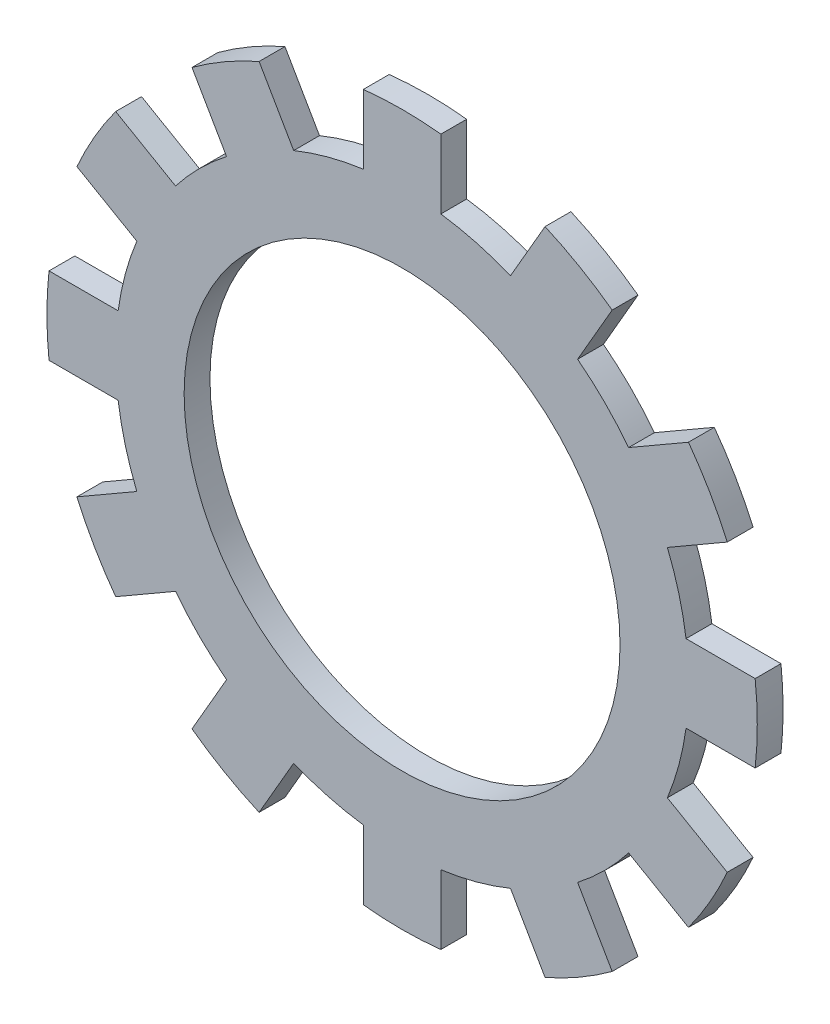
ISO-10303-21;
HEADER;
FILE_DESCRIPTION(('STEP AP214'),'2;1');
FILE_NAME('part.step','',(''),(''),'','','');
FILE_SCHEMA(('AUTOMOTIVE_DESIGN { 1 0 10303 214 1 1 1 1 }'));
ENDSEC;
DATA;
#1=APPLICATION_CONTEXT('core data for automotive mechanical design processes');
#2=APPLICATION_PROTOCOL_DEFINITION('international standard','automotive_design',2000,#1);
#3=PRODUCT_CONTEXT('',#1,'mechanical');
#4=PRODUCT('Part','Part','',(#3));
#5=PRODUCT_RELATED_PRODUCT_CATEGORY('part','',(#4));
#6=PRODUCT_DEFINITION_FORMATION('','',#4);
#7=PRODUCT_DEFINITION_CONTEXT('part definition',#1,'design');
#8=PRODUCT_DEFINITION('design','',#6,#7);
#9=PRODUCT_DEFINITION_SHAPE('','',#8);
#10=(LENGTH_UNIT() NAMED_UNIT(*) SI_UNIT(.MILLI.,.METRE.));
#11=(NAMED_UNIT(*) PLANE_ANGLE_UNIT() SI_UNIT($,.RADIAN.));
#12=(NAMED_UNIT(*) SI_UNIT($,.STERADIAN.) SOLID_ANGLE_UNIT());
#13=UNCERTAINTY_MEASURE_WITH_UNIT(LENGTH_MEASURE(1.E-05),#10,'distance_accuracy_value','');
#14=(GEOMETRIC_REPRESENTATION_CONTEXT(3) GLOBAL_UNCERTAINTY_ASSIGNED_CONTEXT((#13)) GLOBAL_UNIT_ASSIGNED_CONTEXT((#10,
#11,#12)) REPRESENTATION_CONTEXT('',''));
#15=CARTESIAN_POINT('',(0.,0.,0.));
#16=DIRECTION('',(0.,0.,1.));
#17=DIRECTION('',(1.,0.,0.));
#18=AXIS2_PLACEMENT_3D('',#15,#16,#17);
#19=CARTESIAN_POINT('',(0.,0.,0.8));
#20=DIRECTION('',(0.,0.,-1.));
#21=DIRECTION('',(-1.,0.,0.));
#22=AXIS2_PLACEMENT_3D('',#19,#20,#21);
#23=CYLINDRICAL_SURFACE('',#22,17.75);
#24=CARTESIAN_POINT('',(0.,0.,-0.8));
#25=DIRECTION('',(0.,0.,1.));
#26=DIRECTION('',(1.,0.,0.));
#27=AXIS2_PLACEMENT_3D('',#24,#25,#26);
#28=CIRCLE('',#27,17.75);
#29=CARTESIAN_POINT('',(14.0307870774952,10.8719599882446,-0.8));
#30=VERTEX_POINT('',#29);
#31=CARTESIAN_POINT('',(10.8719599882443,14.0307870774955,-0.8));
#32=VERTEX_POINT('',#31);
#33=EDGE_CURVE('E361',#30,#32,#28,.T.);
#34=ORIENTED_EDGE('',*,*,#33,.T.);
#35=DIRECTION('',(0.,0.,-1.));
#36=VECTOR('',#35,1.);
#37=CARTESIAN_POINT('',(10.8719599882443,14.0307870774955,0.8));
#38=LINE('',#37,#36);
#39=CARTESIAN_POINT('',(10.8719599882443,14.0307870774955,0.8));
#40=VERTEX_POINT('',#39);
#41=EDGE_CURVE('E352',#40,#32,#38,.T.);
#42=ORIENTED_EDGE('',*,*,#41,.F.);
#43=CARTESIAN_POINT('',(0.,0.,0.8));
#44=DIRECTION('',(0.,0.,1.));
#45=DIRECTION('',(1.,0.,0.));
#46=AXIS2_PLACEMENT_3D('',#43,#44,#45);
#47=CIRCLE('',#46,17.75);
#48=CARTESIAN_POINT('',(14.0307870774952,10.8719599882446,0.8));
#49=VERTEX_POINT('',#48);
#50=EDGE_CURVE('E64',#49,#40,#47,.T.);
#51=ORIENTED_EDGE('',*,*,#50,.F.);
#52=DIRECTION('',(0.,0.,-1.));
#53=VECTOR('',#52,1.);
#54=CARTESIAN_POINT('',(14.0307870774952,10.8719599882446,0.8));
#55=LINE('',#54,#53);
#56=EDGE_CURVE('E628',#49,#30,#55,.T.);
#57=ORIENTED_EDGE('',*,*,#56,.T.);
#58=EDGE_LOOP('',(#34,#42,#51,#57));
#59=FACE_BOUND('',#58,.T.);
#60=ADVANCED_FACE('F39',(#59),#23,.T.);
#61=DIRECTION('',(0.,0.,-1.));
#62=VECTOR('',#61,1.);
#63=CARTESIAN_POINT('',(6.71503805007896,16.4307870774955,0.8));
#64=LINE('',#63,#62);
#65=CARTESIAN_POINT('',(6.71503805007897,16.4307870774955,0.8));
#66=VERTEX_POINT('',#65);
#67=CARTESIAN_POINT('',(6.71503805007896,16.4307870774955,-0.8));
#68=VERTEX_POINT('',#67);
#69=EDGE_CURVE('E647',#66,#68,#64,.T.);
#70=ORIENTED_EDGE('',*,*,#69,.T.);
#71=CARTESIAN_POINT('',(2.4,17.5869980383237,-0.8));
#72=VERTEX_POINT('',#71);
#73=EDGE_CURVE('E388',#68,#72,#28,.T.);
#74=ORIENTED_EDGE('',*,*,#73,.T.);
#75=DIRECTION('',(0.,0.,-1.));
#76=VECTOR('',#75,1.);
#77=CARTESIAN_POINT('',(2.4,17.5869980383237,0.8));
#78=LINE('',#77,#76);
#79=CARTESIAN_POINT('',(2.4,17.5869980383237,0.8));
#80=VERTEX_POINT('',#79);
#81=EDGE_CURVE('E405',#80,#72,#78,.T.);
#82=ORIENTED_EDGE('',*,*,#81,.F.);
#83=EDGE_CURVE('E50',#66,#80,#47,.T.);
#84=ORIENTED_EDGE('',*,*,#83,.F.);
#85=EDGE_LOOP('',(#70,#74,#82,#84));
#86=FACE_BOUND('',#85,.T.);
#87=ADVANCED_FACE('F817',(#86),#23,.T.);
#88=CARTESIAN_POINT('',(17.5869980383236,2.40000000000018,-0.8));
#89=VERTEX_POINT('',#88);
#90=CARTESIAN_POINT('',(16.4307870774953,6.71503805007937,-0.8));
#91=VERTEX_POINT('',#90);
#92=EDGE_CURVE('E905',#89,#91,#28,.T.);
#93=ORIENTED_EDGE('',*,*,#92,.T.);
#94=DIRECTION('',(0.,0.,-1.));
#95=VECTOR('',#94,1.);
#96=CARTESIAN_POINT('',(16.4307870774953,6.71503805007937,0.8));
#97=LINE('',#96,#95);
#98=CARTESIAN_POINT('',(16.4307870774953,6.71503805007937,0.8));
#99=VERTEX_POINT('',#98);
#100=EDGE_CURVE('E787',#99,#91,#97,.T.);
#101=ORIENTED_EDGE('',*,*,#100,.F.);
#102=CARTESIAN_POINT('',(17.5869980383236,2.40000000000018,0.8));
#103=VERTEX_POINT('',#102);
#104=EDGE_CURVE('E371',#103,#99,#47,.T.);
#105=ORIENTED_EDGE('',*,*,#104,.F.);
#106=DIRECTION('',(0.,0.,-1.));
#107=VECTOR('',#106,1.);
#108=CARTESIAN_POINT('',(17.5869980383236,2.40000000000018,0.8));
#109=LINE('',#108,#107);
#110=EDGE_CURVE('E606',#103,#89,#109,.T.);
#111=ORIENTED_EDGE('',*,*,#110,.T.);
#112=EDGE_LOOP('',(#93,#101,#105,#111));
#113=FACE_BOUND('',#112,.T.);
#114=ADVANCED_FACE('F903',(#113),#23,.T.);
#115=CARTESIAN_POINT('',(16.4307870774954,-6.71503805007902,-0.8));
#116=VERTEX_POINT('',#115);
#117=CARTESIAN_POINT('',(17.5869980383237,-2.39999999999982,-0.8));
#118=VERTEX_POINT('',#117);
#119=EDGE_CURVE('E886',#116,#118,#28,.T.);
#120=ORIENTED_EDGE('',*,*,#119,.T.);
#121=DIRECTION('',(0.,0.,-1.));
#122=VECTOR('',#121,1.);
#123=CARTESIAN_POINT('',(17.5869980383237,-2.39999999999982,0.8));
#124=LINE('',#123,#122);
#125=CARTESIAN_POINT('',(17.5869980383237,-2.39999999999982,0.8));
#126=VERTEX_POINT('',#125);
#127=EDGE_CURVE('E773',#126,#118,#124,.T.);
#128=ORIENTED_EDGE('',*,*,#127,.F.);
#129=CARTESIAN_POINT('',(16.4307870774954,-6.71503805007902,0.8));
#130=VERTEX_POINT('',#129);
#131=EDGE_CURVE('E376',#130,#126,#47,.T.);
#132=ORIENTED_EDGE('',*,*,#131,.F.);
#133=DIRECTION('',(0.,0.,-1.));
#134=VECTOR('',#133,1.);
#135=CARTESIAN_POINT('',(16.4307870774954,-6.71503805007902,0.8));
#136=LINE('',#135,#134);
#137=EDGE_CURVE('E584',#130,#116,#136,.T.);
#138=ORIENTED_EDGE('',*,*,#137,.T.);
#139=EDGE_LOOP('',(#120,#128,#132,#138));
#140=FACE_BOUND('',#139,.T.);
#141=ADVANCED_FACE('F885',(#140),#23,.T.);
#142=CARTESIAN_POINT('',(10.8719599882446,-14.0307870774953,-0.8));
#143=VERTEX_POINT('',#142);
#144=CARTESIAN_POINT('',(14.0307870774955,-10.8719599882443,-0.8));
#145=VERTEX_POINT('',#144);
#146=EDGE_CURVE('E964',#143,#145,#28,.T.);
#147=ORIENTED_EDGE('',*,*,#146,.T.);
#148=DIRECTION('',(0.,0.,-1.));
#149=VECTOR('',#148,1.);
#150=CARTESIAN_POINT('',(14.0307870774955,-10.8719599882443,0.8));
#151=LINE('',#150,#149);
#152=CARTESIAN_POINT('',(14.0307870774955,-10.8719599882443,0.8));
#153=VERTEX_POINT('',#152);
#154=EDGE_CURVE('E759',#153,#145,#151,.T.);
#155=ORIENTED_EDGE('',*,*,#154,.F.);
#156=CARTESIAN_POINT('',(10.8719599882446,-14.0307870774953,0.8));
#157=VERTEX_POINT('',#156);
#158=EDGE_CURVE('E872',#157,#153,#47,.T.);
#159=ORIENTED_EDGE('',*,*,#158,.F.);
#160=DIRECTION('',(0.,0.,-1.));
#161=VECTOR('',#160,1.);
#162=CARTESIAN_POINT('',(10.8719599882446,-14.0307870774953,0.8));
#163=LINE('',#162,#161);
#164=EDGE_CURVE('E562',#157,#143,#163,.T.);
#165=ORIENTED_EDGE('',*,*,#164,.T.);
#166=EDGE_LOOP('',(#147,#155,#159,#165));
#167=FACE_BOUND('',#166,.T.);
#168=ADVANCED_FACE('F974',(#167),#23,.T.);
#169=CARTESIAN_POINT('',(2.4,-17.5869980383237,-0.8));
#170=VERTEX_POINT('',#169);
#171=CARTESIAN_POINT('',(6.71503805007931,-16.4307870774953,-0.8));
#172=VERTEX_POINT('',#171);
#173=EDGE_CURVE('E959',#170,#172,#28,.T.);
#174=ORIENTED_EDGE('',*,*,#173,.T.);
#175=DIRECTION('',(0.,0.,-1.));
#176=VECTOR('',#175,1.);
#177=CARTESIAN_POINT('',(6.71503805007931,-16.4307870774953,0.8));
#178=LINE('',#177,#176);
#179=CARTESIAN_POINT('',(6.71503805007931,-16.4307870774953,0.8));
#180=VERTEX_POINT('',#179);
#181=EDGE_CURVE('E745',#180,#172,#178,.T.);
#182=ORIENTED_EDGE('',*,*,#181,.F.);
#183=CARTESIAN_POINT('',(2.4,-17.5869980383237,0.8));
#184=VERTEX_POINT('',#183);
#185=EDGE_CURVE('E868',#184,#180,#47,.T.);
#186=ORIENTED_EDGE('',*,*,#185,.F.);
#187=DIRECTION('',(0.,0.,-1.));
#188=VECTOR('',#187,1.);
#189=CARTESIAN_POINT('',(2.4,-17.5869980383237,0.8));
#190=LINE('',#189,#188);
#191=EDGE_CURVE('E540',#184,#170,#190,.T.);
#192=ORIENTED_EDGE('',*,*,#191,.T.);
#193=EDGE_LOOP('',(#174,#182,#186,#192));
#194=FACE_BOUND('',#193,.T.);
#195=ADVANCED_FACE('F1402',(#194),#23,.T.);
#196=CARTESIAN_POINT('',(-6.71503805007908,-16.4307870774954,-0.8));
#197=VERTEX_POINT('',#196);
#198=CARTESIAN_POINT('',(-2.4,-17.5869980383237,-0.8));
#199=VERTEX_POINT('',#198);
#200=EDGE_CURVE('E955',#197,#199,#28,.T.);
#201=ORIENTED_EDGE('',*,*,#200,.T.);
#202=DIRECTION('',(0.,0.,-1.));
#203=VECTOR('',#202,1.);
#204=CARTESIAN_POINT('',(-2.4,-17.5869980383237,0.8));
#205=LINE('',#204,#203);
#206=CARTESIAN_POINT('',(-2.4,-17.5869980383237,0.8));
#207=VERTEX_POINT('',#206);
#208=EDGE_CURVE('E731',#207,#199,#205,.T.);
#209=ORIENTED_EDGE('',*,*,#208,.F.);
#210=CARTESIAN_POINT('',(-6.71503805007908,-16.4307870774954,0.8));
#211=VERTEX_POINT('',#210);
#212=EDGE_CURVE('E865',#211,#207,#47,.T.);
#213=ORIENTED_EDGE('',*,*,#212,.F.);
#214=DIRECTION('',(0.,0.,-1.));
#215=VECTOR('',#214,1.);
#216=CARTESIAN_POINT('',(-6.71503805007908,-16.4307870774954,0.8));
#217=LINE('',#216,#215);
#218=EDGE_CURVE('E518',#211,#197,#217,.T.);
#219=ORIENTED_EDGE('',*,*,#218,.T.);
#220=EDGE_LOOP('',(#201,#209,#213,#219));
#221=FACE_BOUND('',#220,.T.);
#222=ADVANCED_FACE('F1394',(#221),#23,.T.);
#223=CARTESIAN_POINT('',(-14.0307870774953,-10.8719599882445,-0.8));
#224=VERTEX_POINT('',#223);
#225=CARTESIAN_POINT('',(-10.8719599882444,-14.0307870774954,-0.8));
#226=VERTEX_POINT('',#225);
#227=EDGE_CURVE('E950',#224,#226,#28,.T.);
#228=ORIENTED_EDGE('',*,*,#227,.T.);
#229=DIRECTION('',(0.,0.,-1.));
#230=VECTOR('',#229,1.);
#231=CARTESIAN_POINT('',(-10.8719599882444,-14.0307870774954,0.8));
#232=LINE('',#231,#230);
#233=CARTESIAN_POINT('',(-10.8719599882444,-14.0307870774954,0.8));
#234=VERTEX_POINT('',#233);
#235=EDGE_CURVE('E717',#234,#226,#232,.T.);
#236=ORIENTED_EDGE('',*,*,#235,.F.);
#237=CARTESIAN_POINT('',(-14.0307870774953,-10.8719599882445,0.8));
#238=VERTEX_POINT('',#237);
#239=EDGE_CURVE('E861',#238,#234,#47,.T.);
#240=ORIENTED_EDGE('',*,*,#239,.F.);
#241=DIRECTION('',(0.,0.,-1.));
#242=VECTOR('',#241,1.);
#243=CARTESIAN_POINT('',(-14.0307870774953,-10.8719599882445,0.8));
#244=LINE('',#243,#242);
#245=EDGE_CURVE('E496',#238,#224,#244,.T.);
#246=ORIENTED_EDGE('',*,*,#245,.T.);
#247=EDGE_LOOP('',(#228,#236,#240,#246));
#248=FACE_BOUND('',#247,.T.);
#249=ADVANCED_FACE('F1386',(#248),#23,.T.);
#250=CARTESIAN_POINT('',(-17.5869980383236,-2.40000000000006,-0.8));
#251=VERTEX_POINT('',#250);
#252=CARTESIAN_POINT('',(-16.4307870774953,-6.71503805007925,-0.8));
#253=VERTEX_POINT('',#252);
#254=EDGE_CURVE('E946',#251,#253,#28,.T.);
#255=ORIENTED_EDGE('',*,*,#254,.T.);
#256=DIRECTION('',(0.,0.,-1.));
#257=VECTOR('',#256,1.);
#258=CARTESIAN_POINT('',(-16.4307870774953,-6.71503805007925,0.8));
#259=LINE('',#258,#257);
#260=CARTESIAN_POINT('',(-16.4307870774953,-6.71503805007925,0.8));
#261=VERTEX_POINT('',#260);
#262=EDGE_CURVE('E703',#261,#253,#259,.T.);
#263=ORIENTED_EDGE('',*,*,#262,.F.);
#264=CARTESIAN_POINT('',(-17.5869980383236,-2.40000000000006,0.8));
#265=VERTEX_POINT('',#264);
#266=EDGE_CURVE('E856',#265,#261,#47,.T.);
#267=ORIENTED_EDGE('',*,*,#266,.F.);
#268=DIRECTION('',(0.,0.,-1.));
#269=VECTOR('',#268,1.);
#270=CARTESIAN_POINT('',(-17.5869980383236,-2.40000000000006,0.8));
#271=LINE('',#270,#269);
#272=EDGE_CURVE('E474',#265,#251,#271,.T.);
#273=ORIENTED_EDGE('',*,*,#272,.T.);
#274=EDGE_LOOP('',(#255,#263,#267,#273));
#275=FACE_BOUND('',#274,.T.);
#276=ADVANCED_FACE('F938',(#275),#23,.T.);
#277=CARTESIAN_POINT('',(-16.4307870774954,6.71503805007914,-0.8));
#278=VERTEX_POINT('',#277);
#279=CARTESIAN_POINT('',(-17.5869980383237,2.39999999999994,-0.8));
#280=VERTEX_POINT('',#279);
#281=EDGE_CURVE('E943',#278,#280,#28,.T.);
#282=ORIENTED_EDGE('',*,*,#281,.T.);
#283=DIRECTION('',(0.,0.,-1.));
#284=VECTOR('',#283,1.);
#285=CARTESIAN_POINT('',(-17.5869980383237,2.39999999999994,0.8));
#286=LINE('',#285,#284);
#287=CARTESIAN_POINT('',(-17.5869980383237,2.39999999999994,0.8));
#288=VERTEX_POINT('',#287);
#289=EDGE_CURVE('E689',#288,#280,#286,.T.);
#290=ORIENTED_EDGE('',*,*,#289,.F.);
#291=CARTESIAN_POINT('',(-16.4307870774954,6.71503805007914,0.8));
#292=VERTEX_POINT('',#291);
#293=EDGE_CURVE('E852',#292,#288,#47,.T.);
#294=ORIENTED_EDGE('',*,*,#293,.F.);
#295=DIRECTION('',(0.,0.,-1.));
#296=VECTOR('',#295,1.);
#297=CARTESIAN_POINT('',(-16.4307870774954,6.71503805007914,0.8));
#298=LINE('',#297,#296);
#299=EDGE_CURVE('E452',#292,#278,#298,.T.);
#300=ORIENTED_EDGE('',*,*,#299,.T.);
#301=EDGE_LOOP('',(#282,#290,#294,#300));
#302=FACE_BOUND('',#301,.T.);
#303=ADVANCED_FACE('F934',(#302),#23,.T.);
#304=CARTESIAN_POINT('',(-10.8719599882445,14.0307870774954,-0.8));
#305=VERTEX_POINT('',#304);
#306=CARTESIAN_POINT('',(-14.0307870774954,10.8719599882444,-0.8));
#307=VERTEX_POINT('',#306);
#308=EDGE_CURVE('E941',#305,#307,#28,.T.);
#309=ORIENTED_EDGE('',*,*,#308,.T.);
#310=DIRECTION('',(0.,0.,-1.));
#311=VECTOR('',#310,1.);
#312=CARTESIAN_POINT('',(-14.0307870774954,10.8719599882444,0.8));
#313=LINE('',#312,#311);
#314=CARTESIAN_POINT('',(-14.0307870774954,10.8719599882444,0.8));
#315=VERTEX_POINT('',#314);
#316=EDGE_CURVE('E675',#315,#307,#313,.T.);
#317=ORIENTED_EDGE('',*,*,#316,.F.);
#318=CARTESIAN_POINT('',(-10.8719599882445,14.0307870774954,0.8));
#319=VERTEX_POINT('',#318);
#320=EDGE_CURVE('E49',#319,#315,#47,.T.);
#321=ORIENTED_EDGE('',*,*,#320,.F.);
#322=DIRECTION('',(0.,0.,-1.));
#323=VECTOR('',#322,1.);
#324=CARTESIAN_POINT('',(-10.8719599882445,14.0307870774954,0.8));
#325=LINE('',#324,#323);
#326=EDGE_CURVE('E430',#319,#305,#325,.T.);
#327=ORIENTED_EDGE('',*,*,#326,.T.);
#328=EDGE_LOOP('',(#309,#317,#321,#327));
#329=FACE_BOUND('',#328,.T.);
#330=ADVANCED_FACE('F928',(#329),#23,.T.);
#331=CARTESIAN_POINT('',(-2.4,17.5869980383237,-0.8));
#332=VERTEX_POINT('',#331);
#333=CARTESIAN_POINT('',(-6.71503805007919,16.4307870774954,-0.8));
#334=VERTEX_POINT('',#333);
#335=EDGE_CURVE('E43',#332,#334,#28,.T.);
#336=ORIENTED_EDGE('',*,*,#335,.T.);
#337=DIRECTION('',(0.,0.,-1.));
#338=VECTOR('',#337,1.);
#339=CARTESIAN_POINT('',(-6.71503805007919,16.4307870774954,0.8));
#340=LINE('',#339,#338);
#341=CARTESIAN_POINT('',(-6.71503805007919,16.4307870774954,0.8));
#342=VERTEX_POINT('',#341);
#343=EDGE_CURVE('E659',#342,#334,#340,.T.);
#344=ORIENTED_EDGE('',*,*,#343,.F.);
#345=CARTESIAN_POINT('',(-2.4,17.5869980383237,0.8));
#346=VERTEX_POINT('',#345);
#347=EDGE_CURVE('E11',#346,#342,#47,.T.);
#348=ORIENTED_EDGE('',*,*,#347,.F.);
#349=DIRECTION('',(0.,0.,-1.));
#350=VECTOR('',#349,1.);
#351=CARTESIAN_POINT('',(-2.4,17.5869980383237,0.8));
#352=LINE('',#351,#350);
#353=EDGE_CURVE('E392',#346,#332,#352,.T.);
#354=ORIENTED_EDGE('',*,*,#353,.T.);
#355=EDGE_LOOP('',(#336,#344,#348,#354));
#356=FACE_BOUND('',#355,.T.);
#357=ADVANCED_FACE('F41',(#356),#23,.T.);
#358=CARTESIAN_POINT('',(0.,0.,0.8));
#359=DIRECTION('',(0.,0.,1.));
#360=DIRECTION('',(1.,0.,0.));
#361=AXIS2_PLACEMENT_3D('',#358,#359,#360);
#362=PLANE('',#361);
#363=ORIENTED_EDGE('',*,*,#347,.T.);
#364=DIRECTION('',(0.500000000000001,-0.866025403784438,0.));
#365=VECTOR('',#364,1.);
#366=CARTESIAN_POINT('',(-8.85588857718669,20.1388489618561,0.8));
#367=LINE('',#366,#365);
#368=CARTESIAN_POINT('',(-8.85588857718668,20.1388489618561,0.8));
#369=VERTEX_POINT('',#368);
#370=EDGE_CURVE('E670',#369,#342,#367,.T.);
#371=ORIENTED_EDGE('',*,*,#370,.F.);
#372=CARTESIAN_POINT('',(0.,0.,0.8));
#373=DIRECTION('',(0.,0.,1.));
#374=DIRECTION('',(0.866025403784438,0.500000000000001,0.));
#375=AXIS2_PLACEMENT_3D('',#372,#373,#374);
#376=CIRCLE('',#375,22.);
#377=CARTESIAN_POINT('',(-13.012810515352,17.7388489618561,0.8));
#378=VERTEX_POINT('',#377);
#379=EDGE_CURVE('E439',#369,#378,#376,.T.);
#380=ORIENTED_EDGE('',*,*,#379,.T.);
#381=DIRECTION('',(0.500000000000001,-0.866025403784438,0.));
#382=VECTOR('',#381,1.);
#383=CARTESIAN_POINT('',(-13.012810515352,17.7388489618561,0.8));
#384=LINE('',#383,#382);
#385=EDGE_CURVE('E434',#378,#319,#384,.T.);
#386=ORIENTED_EDGE('',*,*,#385,.T.);
#387=ORIENTED_EDGE('',*,*,#320,.T.);
#388=DIRECTION('',(0.86602540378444,-0.499999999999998,0.));
#389=VECTOR('',#388,1.);
#390=CARTESIAN_POINT('',(-17.7388489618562,13.0128105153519,0.8));
#391=LINE('',#390,#389);
#392=CARTESIAN_POINT('',(-17.7388489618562,13.0128105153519,0.8));
#393=VERTEX_POINT('',#392);
#394=EDGE_CURVE('E684',#393,#315,#391,.T.);
#395=ORIENTED_EDGE('',*,*,#394,.F.);
#396=CARTESIAN_POINT('',(0.,0.,0.8));
#397=DIRECTION('',(0.,0.,1.));
#398=DIRECTION('',(0.499999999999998,0.86602540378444,0.));
#399=AXIS2_PLACEMENT_3D('',#396,#397,#398);
#400=CIRCLE('',#399,22.);
#401=CARTESIAN_POINT('',(-20.1388489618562,8.85588857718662,0.8));
#402=VERTEX_POINT('',#401);
#403=EDGE_CURVE('E461',#393,#402,#400,.T.);
#404=ORIENTED_EDGE('',*,*,#403,.T.);
#405=DIRECTION('',(0.86602540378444,-0.499999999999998,0.));
#406=VECTOR('',#405,1.);
#407=CARTESIAN_POINT('',(-20.1388489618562,8.85588857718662,0.8));
#408=LINE('',#407,#406);
#409=EDGE_CURVE('E456',#402,#292,#408,.T.);
#410=ORIENTED_EDGE('',*,*,#409,.T.);
#411=ORIENTED_EDGE('',*,*,#293,.T.);
#412=DIRECTION('',(1.,0.,0.));
#413=VECTOR('',#412,1.);
#414=CARTESIAN_POINT('',(-21.8686990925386,2.39999999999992,0.8));
#415=LINE('',#414,#413);
#416=CARTESIAN_POINT('',(-21.8686990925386,2.39999999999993,0.8));
#417=VERTEX_POINT('',#416);
#418=EDGE_CURVE('E698',#417,#288,#415,.T.);
#419=ORIENTED_EDGE('',*,*,#418,.F.);
#420=CARTESIAN_POINT('',(0.,0.,0.8));
#421=DIRECTION('',(0.,0.,1.));
#422=DIRECTION('',(0.,1.,0.));
#423=AXIS2_PLACEMENT_3D('',#420,#421,#422);
#424=CIRCLE('',#423,22.);
#425=CARTESIAN_POINT('',(-21.8686990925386,-2.40000000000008,0.8));
#426=VERTEX_POINT('',#425);
#427=EDGE_CURVE('E483',#417,#426,#424,.T.);
#428=ORIENTED_EDGE('',*,*,#427,.T.);
#429=DIRECTION('',(1.,0.,0.));
#430=VECTOR('',#429,1.);
#431=CARTESIAN_POINT('',(-21.8686990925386,-2.40000000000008,0.8));
#432=LINE('',#431,#430);
#433=EDGE_CURVE('E478',#426,#265,#432,.T.);
#434=ORIENTED_EDGE('',*,*,#433,.T.);
#435=ORIENTED_EDGE('',*,*,#266,.T.);
#436=DIRECTION('',(0.866025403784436,0.500000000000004,0.));
#437=VECTOR('',#436,1.);
#438=CARTESIAN_POINT('',(-20.1388489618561,-8.85588857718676,0.8));
#439=LINE('',#438,#437);
#440=CARTESIAN_POINT('',(-20.1388489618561,-8.85588857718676,0.8));
#441=VERTEX_POINT('',#440);
#442=EDGE_CURVE('E712',#441,#261,#439,.T.);
#443=ORIENTED_EDGE('',*,*,#442,.F.);
#444=CARTESIAN_POINT('',(0.,0.,0.8));
#445=DIRECTION('',(0.,0.,1.));
#446=DIRECTION('',(-0.500000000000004,0.866025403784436,0.));
#447=AXIS2_PLACEMENT_3D('',#444,#445,#446);
#448=CIRCLE('',#447,22.);
#449=CARTESIAN_POINT('',(-17.7388489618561,-13.0128105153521,0.8));
#450=VERTEX_POINT('',#449);
#451=EDGE_CURVE('E505',#441,#450,#448,.T.);
#452=ORIENTED_EDGE('',*,*,#451,.T.);
#453=DIRECTION('',(0.866025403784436,0.500000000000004,0.));
#454=VECTOR('',#453,1.);
#455=CARTESIAN_POINT('',(-17.7388489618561,-13.0128105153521,0.8));
#456=LINE('',#455,#454);
#457=EDGE_CURVE('E500',#450,#238,#456,.T.);
#458=ORIENTED_EDGE('',*,*,#457,.T.);
#459=ORIENTED_EDGE('',*,*,#239,.T.);
#460=DIRECTION('',(0.499999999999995,0.866025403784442,0.));
#461=VECTOR('',#460,1.);
#462=CARTESIAN_POINT('',(-13.0128105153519,-17.7388489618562,0.8));
#463=LINE('',#462,#461);
#464=CARTESIAN_POINT('',(-13.0128105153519,-17.7388489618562,0.8));
#465=VERTEX_POINT('',#464);
#466=EDGE_CURVE('E726',#465,#234,#463,.T.);
#467=ORIENTED_EDGE('',*,*,#466,.F.);
#468=CARTESIAN_POINT('',(0.,0.,0.8));
#469=DIRECTION('',(0.,0.,1.));
#470=DIRECTION('',(-0.866025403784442,0.499999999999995,0.));
#471=AXIS2_PLACEMENT_3D('',#468,#469,#470);
#472=CIRCLE('',#471,22.);
#473=CARTESIAN_POINT('',(-8.85588857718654,-20.1388489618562,0.8));
#474=VERTEX_POINT('',#473);
#475=EDGE_CURVE('E527',#465,#474,#472,.T.);
#476=ORIENTED_EDGE('',*,*,#475,.T.);
#477=DIRECTION('',(0.499999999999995,0.866025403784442,0.));
#478=VECTOR('',#477,1.);
#479=CARTESIAN_POINT('',(-8.85588857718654,-20.1388489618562,0.8));
#480=LINE('',#479,#478);
#481=EDGE_CURVE('E522',#474,#211,#480,.T.);
#482=ORIENTED_EDGE('',*,*,#481,.T.);
#483=ORIENTED_EDGE('',*,*,#212,.T.);
#484=DIRECTION('',(0.,1.,0.));
#485=VECTOR('',#484,1.);
#486=CARTESIAN_POINT('',(-2.4,-21.8686990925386,0.8));
#487=LINE('',#486,#485);
#488=CARTESIAN_POINT('',(-2.4,-21.8686990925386,0.8));
#489=VERTEX_POINT('',#488);
#490=EDGE_CURVE('E740',#489,#207,#487,.T.);
#491=ORIENTED_EDGE('',*,*,#490,.F.);
#492=CARTESIAN_POINT('',(0.,0.,0.8));
#493=DIRECTION('',(0.,0.,1.));
#494=DIRECTION('',(-1.,0.,0.));
#495=AXIS2_PLACEMENT_3D('',#492,#493,#494);
#496=CIRCLE('',#495,22.);
#497=CARTESIAN_POINT('',(2.4,-21.8686990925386,0.8));
#498=VERTEX_POINT('',#497);
#499=EDGE_CURVE('E549',#489,#498,#496,.T.);
#500=ORIENTED_EDGE('',*,*,#499,.T.);
#501=DIRECTION('',(0.,1.,0.));
#502=VECTOR('',#501,1.);
#503=CARTESIAN_POINT('',(2.4,-21.8686990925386,0.8));
#504=LINE('',#503,#502);
#505=EDGE_CURVE('E544',#498,#184,#504,.T.);
#506=ORIENTED_EDGE('',*,*,#505,.T.);
#507=ORIENTED_EDGE('',*,*,#185,.T.);
#508=DIRECTION('',(-0.500000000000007,0.866025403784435,0.));
#509=VECTOR('',#508,1.);
#510=CARTESIAN_POINT('',(8.85588857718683,-20.1388489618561,0.8));
#511=LINE('',#510,#509);
#512=CARTESIAN_POINT('',(8.85588857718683,-20.1388489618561,0.8));
#513=VERTEX_POINT('',#512);
#514=EDGE_CURVE('E754',#513,#180,#511,.T.);
#515=ORIENTED_EDGE('',*,*,#514,.F.);
#516=CARTESIAN_POINT('',(0.,0.,0.8));
#517=DIRECTION('',(0.,0.,1.));
#518=DIRECTION('',(-0.866025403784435,-0.500000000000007,0.));
#519=AXIS2_PLACEMENT_3D('',#516,#517,#518);
#520=CIRCLE('',#519,22.);
#521=CARTESIAN_POINT('',(13.0128105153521,-17.738848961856,0.8));
#522=VERTEX_POINT('',#521);
#523=EDGE_CURVE('E571',#513,#522,#520,.T.);
#524=ORIENTED_EDGE('',*,*,#523,.T.);
#525=DIRECTION('',(-0.500000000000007,0.866025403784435,0.));
#526=VECTOR('',#525,1.);
#527=CARTESIAN_POINT('',(13.0128105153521,-17.738848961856,0.8));
#528=LINE('',#527,#526);
#529=EDGE_CURVE('E566',#522,#157,#528,.T.);
#530=ORIENTED_EDGE('',*,*,#529,.T.);
#531=ORIENTED_EDGE('',*,*,#158,.T.);
#532=DIRECTION('',(-0.866025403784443,0.499999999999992,0.));
#533=VECTOR('',#532,1.);
#534=CARTESIAN_POINT('',(17.7388489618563,-13.0128105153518,0.8));
#535=LINE('',#534,#533);
#536=CARTESIAN_POINT('',(17.7388489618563,-13.0128105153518,0.8));
#537=VERTEX_POINT('',#536);
#538=EDGE_CURVE('E768',#537,#153,#535,.T.);
#539=ORIENTED_EDGE('',*,*,#538,.F.);
#540=CARTESIAN_POINT('',(0.,0.,0.8));
#541=DIRECTION('',(0.,0.,1.));
#542=DIRECTION('',(-0.499999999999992,-0.866025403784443,0.));
#543=AXIS2_PLACEMENT_3D('',#540,#541,#542);
#544=CIRCLE('',#543,22.);
#545=CARTESIAN_POINT('',(20.1388489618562,-8.85588857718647,0.8));
#546=VERTEX_POINT('',#545);
#547=EDGE_CURVE('E593',#537,#546,#544,.T.);
#548=ORIENTED_EDGE('',*,*,#547,.T.);
#549=DIRECTION('',(-0.866025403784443,0.499999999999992,0.));
#550=VECTOR('',#549,1.);
#551=CARTESIAN_POINT('',(20.1388489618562,-8.85588857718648,0.8));
#552=LINE('',#551,#550);
#553=EDGE_CURVE('E588',#546,#130,#552,.T.);
#554=ORIENTED_EDGE('',*,*,#553,.T.);
#555=ORIENTED_EDGE('',*,*,#131,.T.);
#556=DIRECTION('',(-1.,0.,0.));
#557=VECTOR('',#556,1.);
#558=CARTESIAN_POINT('',(21.8686990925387,-2.39999999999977,0.8));
#559=LINE('',#558,#557);
#560=CARTESIAN_POINT('',(21.8686990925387,-2.39999999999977,0.8));
#561=VERTEX_POINT('',#560);
#562=EDGE_CURVE('E782',#561,#126,#559,.T.);
#563=ORIENTED_EDGE('',*,*,#562,.F.);
#564=CARTESIAN_POINT('',(0.,0.,0.8));
#565=DIRECTION('',(0.,0.,1.));
#566=DIRECTION('',(0.,-1.,0.));
#567=AXIS2_PLACEMENT_3D('',#564,#565,#566);
#568=CIRCLE('',#567,22.);
#569=CARTESIAN_POINT('',(21.8686990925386,2.40000000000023,0.8));
#570=VERTEX_POINT('',#569);
#571=EDGE_CURVE('E615',#561,#570,#568,.T.);
#572=ORIENTED_EDGE('',*,*,#571,.T.);
#573=DIRECTION('',(-1.,0.,0.));
#574=VECTOR('',#573,1.);
#575=CARTESIAN_POINT('',(21.8686990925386,2.40000000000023,0.8));
#576=LINE('',#575,#574);
#577=EDGE_CURVE('E610',#570,#103,#576,.T.);
#578=ORIENTED_EDGE('',*,*,#577,.T.);
#579=ORIENTED_EDGE('',*,*,#104,.T.);
#580=DIRECTION('',(-0.866025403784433,-0.50000000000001,0.));
#581=VECTOR('',#580,1.);
#582=CARTESIAN_POINT('',(20.1388489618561,8.8558885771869,0.8));
#583=LINE('',#582,#581);
#584=CARTESIAN_POINT('',(20.1388489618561,8.85588857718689,0.8));
#585=VERTEX_POINT('',#584);
#586=EDGE_CURVE('E795',#585,#99,#583,.T.);
#587=ORIENTED_EDGE('',*,*,#586,.F.);
#588=CARTESIAN_POINT('',(0.,0.,0.8));
#589=DIRECTION('',(0.,0.,1.));
#590=DIRECTION('',(0.50000000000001,-0.866025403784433,0.));
#591=AXIS2_PLACEMENT_3D('',#588,#589,#590);
#592=CIRCLE('',#591,22.);
#593=CARTESIAN_POINT('',(17.738848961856,13.0128105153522,0.8));
#594=VERTEX_POINT('',#593);
#595=EDGE_CURVE('E635',#585,#594,#592,.T.);
#596=ORIENTED_EDGE('',*,*,#595,.T.);
#597=DIRECTION('',(-0.866025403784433,-0.50000000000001,0.));
#598=VECTOR('',#597,1.);
#599=CARTESIAN_POINT('',(17.738848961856,13.0128105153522,0.8));
#600=LINE('',#599,#598);
#601=EDGE_CURVE('E368',#594,#49,#600,.T.);
#602=ORIENTED_EDGE('',*,*,#601,.T.);
#603=ORIENTED_EDGE('',*,*,#50,.T.);
#604=DIRECTION('',(-0.499999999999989,-0.866025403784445,0.));
#605=VECTOR('',#604,1.);
#606=CARTESIAN_POINT('',(13.0128105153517,17.7388489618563,0.8));
#607=LINE('',#606,#605);
#608=CARTESIAN_POINT('',(13.0128105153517,17.7388489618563,0.8));
#609=VERTEX_POINT('',#608);
#610=EDGE_CURVE('E349',#609,#40,#607,.T.);
#611=ORIENTED_EDGE('',*,*,#610,.F.);
#612=CARTESIAN_POINT('',(0.,0.,0.8));
#613=DIRECTION('',(0.,0.,1.));
#614=DIRECTION('',(0.866025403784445,-0.499999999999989,0.));
#615=AXIS2_PLACEMENT_3D('',#612,#613,#614);
#616=CIRCLE('',#615,22.);
#617=CARTESIAN_POINT('',(8.8558885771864,20.1388489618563,0.8));
#618=VERTEX_POINT('',#617);
#619=EDGE_CURVE('E655',#609,#618,#616,.T.);
#620=ORIENTED_EDGE('',*,*,#619,.T.);
#621=DIRECTION('',(-0.499999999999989,-0.866025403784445,0.));
#622=VECTOR('',#621,1.);
#623=CARTESIAN_POINT('',(8.85588857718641,20.1388489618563,0.8));
#624=LINE('',#623,#622);
#625=EDGE_CURVE('E650',#618,#66,#624,.T.);
#626=ORIENTED_EDGE('',*,*,#625,.T.);
#627=ORIENTED_EDGE('',*,*,#83,.T.);
#628=DIRECTION('',(0.,-1.,0.));
#629=VECTOR('',#628,1.);
#630=CARTESIAN_POINT('',(2.4,21.8686990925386,0.8));
#631=LINE('',#630,#629);
#632=CARTESIAN_POINT('',(2.4,21.8686990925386,0.8));
#633=VERTEX_POINT('',#632);
#634=EDGE_CURVE('E418',#633,#80,#631,.T.);
#635=ORIENTED_EDGE('',*,*,#634,.F.);
#636=CARTESIAN_POINT('',(0.,0.,0.8));
#637=DIRECTION('',(0.,0.,1.));
#638=DIRECTION('',(1.,0.,0.));
#639=AXIS2_PLACEMENT_3D('',#636,#637,#638);
#640=CIRCLE('',#639,22.);
#641=CARTESIAN_POINT('',(-2.4,21.8686990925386,0.8));
#642=VERTEX_POINT('',#641);
#643=EDGE_CURVE('E401',#633,#642,#640,.T.);
#644=ORIENTED_EDGE('',*,*,#643,.T.);
#645=DIRECTION('',(0.,-1.,0.));
#646=VECTOR('',#645,1.);
#647=CARTESIAN_POINT('',(-2.4,21.8686990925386,0.8));
#648=LINE('',#647,#646);
#649=EDGE_CURVE('E396',#642,#346,#648,.T.);
#650=ORIENTED_EDGE('',*,*,#649,.T.);
#651=EDGE_LOOP('',(#363,#371,#380,#386,#387,#395,#404,#410,#411,#419,#428,#434,#435,#443,#452,
#458,#459,#467,#476,#482,#483,#491,#500,#506,#507,#515,#524,#530,#531,#539,#548,#554,#555,#563,
#572,#578,#579,#587,#596,#602,#603,#611,#620,#626,#627,#635,#644,#650));
#652=FACE_BOUND('',#651,.T.);
#653=CARTESIAN_POINT('',(0.,0.,0.8));
#654=DIRECTION('',(0.,0.,1.));
#655=DIRECTION('',(1.,0.,0.));
#656=AXIS2_PLACEMENT_3D('',#653,#654,#655);
#657=CIRCLE('',#656,13.5);
#658=CARTESIAN_POINT('',(13.5,0.,0.8));
#659=VERTEX_POINT('',#658);
#660=EDGE_CURVE('E383',#659,#659,#657,.T.);
#661=ORIENTED_EDGE('',*,*,#660,.F.);
#662=EDGE_LOOP('',(#661));
#663=FACE_BOUND('',#662,.T.);
#664=ADVANCED_FACE('F365',(#652,#663),#362,.T.);
#665=CARTESIAN_POINT('',(0.,0.,-0.8));
#666=DIRECTION('',(0.,0.,1.));
#667=DIRECTION('',(1.,0.,0.));
#668=AXIS2_PLACEMENT_3D('',#665,#666,#667);
#669=PLANE('',#668);
#670=ORIENTED_EDGE('',*,*,#335,.F.);
#671=DIRECTION('',(0.,-1.,0.));
#672=VECTOR('',#671,1.);
#673=CARTESIAN_POINT('',(-2.4,21.8686990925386,-0.8));
#674=LINE('',#673,#672);
#675=CARTESIAN_POINT('',(-2.4,21.8686990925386,-0.8));
#676=VERTEX_POINT('',#675);
#677=EDGE_CURVE('E397',#676,#332,#674,.T.);
#678=ORIENTED_EDGE('',*,*,#677,.F.);
#679=CARTESIAN_POINT('',(0.,0.,-0.8));
#680=DIRECTION('',(0.,0.,1.));
#681=DIRECTION('',(1.,0.,0.));
#682=AXIS2_PLACEMENT_3D('',#679,#680,#681);
#683=CIRCLE('',#682,22.);
#684=CARTESIAN_POINT('',(2.4,21.8686990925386,-0.8));
#685=VERTEX_POINT('',#684);
#686=EDGE_CURVE('E402',#685,#676,#683,.T.);
#687=ORIENTED_EDGE('',*,*,#686,.F.);
#688=DIRECTION('',(0.,-1.,0.));
#689=VECTOR('',#688,1.);
#690=CARTESIAN_POINT('',(2.4,21.8686990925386,-0.8));
#691=LINE('',#690,#689);
#692=EDGE_CURVE('E419',#685,#72,#691,.T.);
#693=ORIENTED_EDGE('',*,*,#692,.T.);
#694=ORIENTED_EDGE('',*,*,#73,.F.);
#695=DIRECTION('',(-0.499999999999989,-0.866025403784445,0.));
#696=VECTOR('',#695,1.);
#697=CARTESIAN_POINT('',(8.85588857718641,20.1388489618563,-0.8));
#698=LINE('',#697,#696);
#699=CARTESIAN_POINT('',(8.8558885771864,20.1388489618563,-0.8));
#700=VERTEX_POINT('',#699);
#701=EDGE_CURVE('E651',#700,#68,#698,.T.);
#702=ORIENTED_EDGE('',*,*,#701,.F.);
#703=CARTESIAN_POINT('',(0.,0.,-0.8));
#704=DIRECTION('',(0.,0.,1.));
#705=DIRECTION('',(0.866025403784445,-0.499999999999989,0.));
#706=AXIS2_PLACEMENT_3D('',#703,#704,#705);
#707=CIRCLE('',#706,22.);
#708=CARTESIAN_POINT('',(13.0128105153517,17.7388489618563,-0.8));
#709=VERTEX_POINT('',#708);
#710=EDGE_CURVE('E656',#709,#700,#707,.T.);
#711=ORIENTED_EDGE('',*,*,#710,.F.);
#712=DIRECTION('',(-0.499999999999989,-0.866025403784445,0.));
#713=VECTOR('',#712,1.);
#714=CARTESIAN_POINT('',(13.0128105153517,17.7388489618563,-0.8));
#715=LINE('',#714,#713);
#716=EDGE_CURVE('E358',#709,#32,#715,.T.);
#717=ORIENTED_EDGE('',*,*,#716,.T.);
#718=ORIENTED_EDGE('',*,*,#33,.F.);
#719=DIRECTION('',(-0.866025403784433,-0.50000000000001,0.));
#720=VECTOR('',#719,1.);
#721=CARTESIAN_POINT('',(17.738848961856,13.0128105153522,-0.8));
#722=LINE('',#721,#720);
#723=CARTESIAN_POINT('',(17.738848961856,13.0128105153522,-0.8));
#724=VERTEX_POINT('',#723);
#725=EDGE_CURVE('E631',#724,#30,#722,.T.);
#726=ORIENTED_EDGE('',*,*,#725,.F.);
#727=CARTESIAN_POINT('',(0.,0.,-0.8));
#728=DIRECTION('',(0.,0.,1.));
#729=DIRECTION('',(0.50000000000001,-0.866025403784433,0.));
#730=AXIS2_PLACEMENT_3D('',#727,#728,#729);
#731=CIRCLE('',#730,22.);
#732=CARTESIAN_POINT('',(20.1388489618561,8.85588857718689,-0.8));
#733=VERTEX_POINT('',#732);
#734=EDGE_CURVE('E636',#733,#724,#731,.T.);
#735=ORIENTED_EDGE('',*,*,#734,.F.);
#736=DIRECTION('',(-0.866025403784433,-0.50000000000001,0.));
#737=VECTOR('',#736,1.);
#738=CARTESIAN_POINT('',(20.1388489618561,8.8558885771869,-0.8));
#739=LINE('',#738,#737);
#740=EDGE_CURVE('E363',#733,#91,#739,.T.);
#741=ORIENTED_EDGE('',*,*,#740,.T.);
#742=ORIENTED_EDGE('',*,*,#92,.F.);
#743=DIRECTION('',(-1.,0.,0.));
#744=VECTOR('',#743,1.);
#745=CARTESIAN_POINT('',(21.8686990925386,2.40000000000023,-0.8));
#746=LINE('',#745,#744);
#747=CARTESIAN_POINT('',(21.8686990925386,2.40000000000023,-0.8));
#748=VERTEX_POINT('',#747);
#749=EDGE_CURVE('E611',#748,#89,#746,.T.);
#750=ORIENTED_EDGE('',*,*,#749,.F.);
#751=CARTESIAN_POINT('',(0.,0.,-0.8));
#752=DIRECTION('',(0.,0.,1.));
#753=DIRECTION('',(0.,-1.,0.));
#754=AXIS2_PLACEMENT_3D('',#751,#752,#753);
#755=CIRCLE('',#754,22.);
#756=CARTESIAN_POINT('',(21.8686990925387,-2.39999999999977,-0.8));
#757=VERTEX_POINT('',#756);
#758=EDGE_CURVE('E616',#757,#748,#755,.T.);
#759=ORIENTED_EDGE('',*,*,#758,.F.);
#760=DIRECTION('',(-1.,0.,0.));
#761=VECTOR('',#760,1.);
#762=CARTESIAN_POINT('',(21.8686990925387,-2.39999999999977,-0.8));
#763=LINE('',#762,#761);
#764=EDGE_CURVE('E783',#757,#118,#763,.T.);
#765=ORIENTED_EDGE('',*,*,#764,.T.);
#766=ORIENTED_EDGE('',*,*,#119,.F.);
#767=DIRECTION('',(-0.866025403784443,0.499999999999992,0.));
#768=VECTOR('',#767,1.);
#769=CARTESIAN_POINT('',(20.1388489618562,-8.85588857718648,-0.8));
#770=LINE('',#769,#768);
#771=CARTESIAN_POINT('',(20.1388489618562,-8.85588857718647,-0.8));
#772=VERTEX_POINT('',#771);
#773=EDGE_CURVE('E589',#772,#116,#770,.T.);
#774=ORIENTED_EDGE('',*,*,#773,.F.);
#775=CARTESIAN_POINT('',(0.,0.,-0.8));
#776=DIRECTION('',(0.,0.,1.));
#777=DIRECTION('',(-0.499999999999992,-0.866025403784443,0.));
#778=AXIS2_PLACEMENT_3D('',#775,#776,#777);
#779=CIRCLE('',#778,22.);
#780=CARTESIAN_POINT('',(17.7388489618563,-13.0128105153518,-0.8));
#781=VERTEX_POINT('',#780);
#782=EDGE_CURVE('E594',#781,#772,#779,.T.);
#783=ORIENTED_EDGE('',*,*,#782,.F.);
#784=DIRECTION('',(-0.866025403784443,0.499999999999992,0.));
#785=VECTOR('',#784,1.);
#786=CARTESIAN_POINT('',(17.7388489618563,-13.0128105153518,-0.8));
#787=LINE('',#786,#785);
#788=EDGE_CURVE('E769',#781,#145,#787,.T.);
#789=ORIENTED_EDGE('',*,*,#788,.T.);
#790=ORIENTED_EDGE('',*,*,#146,.F.);
#791=DIRECTION('',(-0.500000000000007,0.866025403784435,0.));
#792=VECTOR('',#791,1.);
#793=CARTESIAN_POINT('',(13.0128105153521,-17.738848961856,-0.8));
#794=LINE('',#793,#792);
#795=CARTESIAN_POINT('',(13.0128105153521,-17.738848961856,-0.8));
#796=VERTEX_POINT('',#795);
#797=EDGE_CURVE('E567',#796,#143,#794,.T.);
#798=ORIENTED_EDGE('',*,*,#797,.F.);
#799=CARTESIAN_POINT('',(0.,0.,-0.8));
#800=DIRECTION('',(0.,0.,1.));
#801=DIRECTION('',(-0.866025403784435,-0.500000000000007,0.));
#802=AXIS2_PLACEMENT_3D('',#799,#800,#801);
#803=CIRCLE('',#802,22.);
#804=CARTESIAN_POINT('',(8.85588857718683,-20.1388489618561,-0.8));
#805=VERTEX_POINT('',#804);
#806=EDGE_CURVE('E572',#805,#796,#803,.T.);
#807=ORIENTED_EDGE('',*,*,#806,.F.);
#808=DIRECTION('',(-0.500000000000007,0.866025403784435,0.));
#809=VECTOR('',#808,1.);
#810=CARTESIAN_POINT('',(8.85588857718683,-20.1388489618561,-0.8));
#811=LINE('',#810,#809);
#812=EDGE_CURVE('E755',#805,#172,#811,.T.);
#813=ORIENTED_EDGE('',*,*,#812,.T.);
#814=ORIENTED_EDGE('',*,*,#173,.F.);
#815=DIRECTION('',(0.,1.,0.));
#816=VECTOR('',#815,1.);
#817=CARTESIAN_POINT('',(2.4,-21.8686990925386,-0.8));
#818=LINE('',#817,#816);
#819=CARTESIAN_POINT('',(2.4,-21.8686990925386,-0.8));
#820=VERTEX_POINT('',#819);
#821=EDGE_CURVE('E545',#820,#170,#818,.T.);
#822=ORIENTED_EDGE('',*,*,#821,.F.);
#823=CARTESIAN_POINT('',(0.,0.,-0.8));
#824=DIRECTION('',(0.,0.,1.));
#825=DIRECTION('',(-1.,0.,0.));
#826=AXIS2_PLACEMENT_3D('',#823,#824,#825);
#827=CIRCLE('',#826,22.);
#828=CARTESIAN_POINT('',(-2.4,-21.8686990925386,-0.8));
#829=VERTEX_POINT('',#828);
#830=EDGE_CURVE('E550',#829,#820,#827,.T.);
#831=ORIENTED_EDGE('',*,*,#830,.F.);
#832=DIRECTION('',(0.,1.,0.));
#833=VECTOR('',#832,1.);
#834=CARTESIAN_POINT('',(-2.4,-21.8686990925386,-0.8));
#835=LINE('',#834,#833);
#836=EDGE_CURVE('E741',#829,#199,#835,.T.);
#837=ORIENTED_EDGE('',*,*,#836,.T.);
#838=ORIENTED_EDGE('',*,*,#200,.F.);
#839=DIRECTION('',(0.499999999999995,0.866025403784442,0.));
#840=VECTOR('',#839,1.);
#841=CARTESIAN_POINT('',(-8.85588857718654,-20.1388489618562,-0.8));
#842=LINE('',#841,#840);
#843=CARTESIAN_POINT('',(-8.85588857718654,-20.1388489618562,-0.8));
#844=VERTEX_POINT('',#843);
#845=EDGE_CURVE('E523',#844,#197,#842,.T.);
#846=ORIENTED_EDGE('',*,*,#845,.F.);
#847=CARTESIAN_POINT('',(0.,0.,-0.8));
#848=DIRECTION('',(0.,0.,1.));
#849=DIRECTION('',(-0.866025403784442,0.499999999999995,0.));
#850=AXIS2_PLACEMENT_3D('',#847,#848,#849);
#851=CIRCLE('',#850,22.);
#852=CARTESIAN_POINT('',(-13.0128105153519,-17.7388489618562,-0.8));
#853=VERTEX_POINT('',#852);
#854=EDGE_CURVE('E528',#853,#844,#851,.T.);
#855=ORIENTED_EDGE('',*,*,#854,.F.);
#856=DIRECTION('',(0.499999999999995,0.866025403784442,0.));
#857=VECTOR('',#856,1.);
#858=CARTESIAN_POINT('',(-13.0128105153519,-17.7388489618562,-0.8));
#859=LINE('',#858,#857);
#860=EDGE_CURVE('E727',#853,#226,#859,.T.);
#861=ORIENTED_EDGE('',*,*,#860,.T.);
#862=ORIENTED_EDGE('',*,*,#227,.F.);
#863=DIRECTION('',(0.866025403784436,0.500000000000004,0.));
#864=VECTOR('',#863,1.);
#865=CARTESIAN_POINT('',(-17.7388489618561,-13.0128105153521,-0.8));
#866=LINE('',#865,#864);
#867=CARTESIAN_POINT('',(-17.7388489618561,-13.0128105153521,-0.8));
#868=VERTEX_POINT('',#867);
#869=EDGE_CURVE('E501',#868,#224,#866,.T.);
#870=ORIENTED_EDGE('',*,*,#869,.F.);
#871=CARTESIAN_POINT('',(0.,0.,-0.8));
#872=DIRECTION('',(0.,0.,1.));
#873=DIRECTION('',(-0.500000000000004,0.866025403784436,0.));
#874=AXIS2_PLACEMENT_3D('',#871,#872,#873);
#875=CIRCLE('',#874,22.);
#876=CARTESIAN_POINT('',(-20.1388489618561,-8.85588857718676,-0.8));
#877=VERTEX_POINT('',#876);
#878=EDGE_CURVE('E506',#877,#868,#875,.T.);
#879=ORIENTED_EDGE('',*,*,#878,.F.);
#880=DIRECTION('',(0.866025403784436,0.500000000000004,0.));
#881=VECTOR('',#880,1.);
#882=CARTESIAN_POINT('',(-20.1388489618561,-8.85588857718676,-0.8));
#883=LINE('',#882,#881);
#884=EDGE_CURVE('E713',#877,#253,#883,.T.);
#885=ORIENTED_EDGE('',*,*,#884,.T.);
#886=ORIENTED_EDGE('',*,*,#254,.F.);
#887=DIRECTION('',(1.,0.,0.));
#888=VECTOR('',#887,1.);
#889=CARTESIAN_POINT('',(-21.8686990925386,-2.40000000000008,-0.8));
#890=LINE('',#889,#888);
#891=CARTESIAN_POINT('',(-21.8686990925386,-2.40000000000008,-0.8));
#892=VERTEX_POINT('',#891);
#893=EDGE_CURVE('E479',#892,#251,#890,.T.);
#894=ORIENTED_EDGE('',*,*,#893,.F.);
#895=CARTESIAN_POINT('',(0.,0.,-0.8));
#896=DIRECTION('',(0.,0.,1.));
#897=DIRECTION('',(0.,1.,0.));
#898=AXIS2_PLACEMENT_3D('',#895,#896,#897);
#899=CIRCLE('',#898,22.);
#900=CARTESIAN_POINT('',(-21.8686990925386,2.39999999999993,-0.8));
#901=VERTEX_POINT('',#900);
#902=EDGE_CURVE('E484',#901,#892,#899,.T.);
#903=ORIENTED_EDGE('',*,*,#902,.F.);
#904=DIRECTION('',(1.,0.,0.));
#905=VECTOR('',#904,1.);
#906=CARTESIAN_POINT('',(-21.8686990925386,2.39999999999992,-0.8));
#907=LINE('',#906,#905);
#908=EDGE_CURVE('E699',#901,#280,#907,.T.);
#909=ORIENTED_EDGE('',*,*,#908,.T.);
#910=ORIENTED_EDGE('',*,*,#281,.F.);
#911=DIRECTION('',(0.86602540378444,-0.499999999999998,0.));
#912=VECTOR('',#911,1.);
#913=CARTESIAN_POINT('',(-20.1388489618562,8.85588857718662,-0.8));
#914=LINE('',#913,#912);
#915=CARTESIAN_POINT('',(-20.1388489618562,8.85588857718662,-0.8));
#916=VERTEX_POINT('',#915);
#917=EDGE_CURVE('E457',#916,#278,#914,.T.);
#918=ORIENTED_EDGE('',*,*,#917,.F.);
#919=CARTESIAN_POINT('',(0.,0.,-0.8));
#920=DIRECTION('',(0.,0.,1.));
#921=DIRECTION('',(0.499999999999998,0.86602540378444,0.));
#922=AXIS2_PLACEMENT_3D('',#919,#920,#921);
#923=CIRCLE('',#922,22.);
#924=CARTESIAN_POINT('',(-17.7388489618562,13.0128105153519,-0.8));
#925=VERTEX_POINT('',#924);
#926=EDGE_CURVE('E462',#925,#916,#923,.T.);
#927=ORIENTED_EDGE('',*,*,#926,.F.);
#928=DIRECTION('',(0.86602540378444,-0.499999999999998,0.));
#929=VECTOR('',#928,1.);
#930=CARTESIAN_POINT('',(-17.7388489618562,13.0128105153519,-0.8));
#931=LINE('',#930,#929);
#932=EDGE_CURVE('E685',#925,#307,#931,.T.);
#933=ORIENTED_EDGE('',*,*,#932,.T.);
#934=ORIENTED_EDGE('',*,*,#308,.F.);
#935=DIRECTION('',(0.500000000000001,-0.866025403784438,0.));
#936=VECTOR('',#935,1.);
#937=CARTESIAN_POINT('',(-13.012810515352,17.7388489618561,-0.8));
#938=LINE('',#937,#936);
#939=CARTESIAN_POINT('',(-13.012810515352,17.7388489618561,-0.8));
#940=VERTEX_POINT('',#939);
#941=EDGE_CURVE('E435',#940,#305,#938,.T.);
#942=ORIENTED_EDGE('',*,*,#941,.F.);
#943=CARTESIAN_POINT('',(0.,0.,-0.8));
#944=DIRECTION('',(0.,0.,1.));
#945=DIRECTION('',(0.866025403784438,0.500000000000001,0.));
#946=AXIS2_PLACEMENT_3D('',#943,#944,#945);
#947=CIRCLE('',#946,22.);
#948=CARTESIAN_POINT('',(-8.85588857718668,20.1388489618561,-0.8));
#949=VERTEX_POINT('',#948);
#950=EDGE_CURVE('E440',#949,#940,#947,.T.);
#951=ORIENTED_EDGE('',*,*,#950,.F.);
#952=DIRECTION('',(0.500000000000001,-0.866025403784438,0.));
#953=VECTOR('',#952,1.);
#954=CARTESIAN_POINT('',(-8.85588857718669,20.1388489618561,-0.8));
#955=LINE('',#954,#953);
#956=EDGE_CURVE('E671',#949,#334,#955,.T.);
#957=ORIENTED_EDGE('',*,*,#956,.T.);
#958=EDGE_LOOP('',(#670,#678,#687,#693,#694,#702,#711,#717,#718,#726,#735,#741,#742,#750,#759,
#765,#766,#774,#783,#789,#790,#798,#807,#813,#814,#822,#831,#837,#838,#846,#855,#861,#862,#870,
#879,#885,#886,#894,#903,#909,#910,#918,#927,#933,#934,#942,#951,#957));
#959=FACE_BOUND('',#958,.T.);
#960=CARTESIAN_POINT('',(0.,0.,-0.8));
#961=DIRECTION('',(0.,0.,1.));
#962=DIRECTION('',(1.,0.,0.));
#963=AXIS2_PLACEMENT_3D('',#960,#961,#962);
#964=CIRCLE('',#963,13.5);
#965=CARTESIAN_POINT('',(13.5,0.,-0.8));
#966=VERTEX_POINT('',#965);
#967=EDGE_CURVE('E379',#966,#966,#964,.T.);
#968=ORIENTED_EDGE('',*,*,#967,.T.);
#969=EDGE_LOOP('',(#968));
#970=FACE_BOUND('',#969,.T.);
#971=ADVANCED_FACE('F805',(#959,#970),#669,.F.);
#972=CARTESIAN_POINT('',(0.,0.,0.8));
#973=DIRECTION('',(0.,0.,-1.));
#974=DIRECTION('',(-1.,0.,0.));
#975=AXIS2_PLACEMENT_3D('',#972,#973,#974);
#976=CYLINDRICAL_SURFACE('',#975,13.5);
#977=ORIENTED_EDGE('',*,*,#660,.T.);
#978=EDGE_LOOP('',(#977));
#979=FACE_BOUND('',#978,.T.);
#980=ORIENTED_EDGE('',*,*,#967,.F.);
#981=EDGE_LOOP('',(#980));
#982=FACE_BOUND('',#981,.T.);
#983=ADVANCED_FACE('F1054',(#979,#982),#976,.F.);
#984=CARTESIAN_POINT('',(0.,0.,0.8));
#985=DIRECTION('',(0.,0.,-1.));
#986=DIRECTION('',(-1.,0.,0.));
#987=AXIS2_PLACEMENT_3D('',#984,#985,#986);
#988=CYLINDRICAL_SURFACE('',#987,22.);
#989=ORIENTED_EDGE('',*,*,#686,.T.);
#990=DIRECTION('',(0.,0.,-1.));
#991=VECTOR('',#990,1.);
#992=CARTESIAN_POINT('',(-2.4,21.8686990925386,0.8));
#993=LINE('',#992,#991);
#994=EDGE_CURVE('E384',#642,#676,#993,.T.);
#995=ORIENTED_EDGE('',*,*,#994,.F.);
#996=ORIENTED_EDGE('',*,*,#643,.F.);
#997=DIRECTION('',(0.,0.,-1.));
#998=VECTOR('',#997,1.);
#999=CARTESIAN_POINT('',(2.4,21.8686990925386,0.8));
#1000=LINE('',#999,#998);
#1001=EDGE_CURVE('E414',#633,#685,#1000,.T.);
#1002=ORIENTED_EDGE('',*,*,#1001,.T.);
#1003=EDGE_LOOP('',(#989,#995,#996,#1002));
#1004=FACE_BOUND('',#1003,.T.);
#1005=ADVANCED_FACE('F826',(#1004),#988,.T.);
#1006=CARTESIAN_POINT('',(-2.4,21.8686990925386,0.8));
#1007=DIRECTION('',(1.,0.,0.));
#1008=DIRECTION('',(0.,1.,0.));
#1009=AXIS2_PLACEMENT_3D('',#1006,#1007,#1008);
#1010=PLANE('',#1009);
#1011=ORIENTED_EDGE('',*,*,#677,.T.);
#1012=ORIENTED_EDGE('',*,*,#353,.F.);
#1013=ORIENTED_EDGE('',*,*,#649,.F.);
#1014=ORIENTED_EDGE('',*,*,#994,.T.);
#1015=EDGE_LOOP('',(#1011,#1012,#1013,#1014));
#1016=FACE_BOUND('',#1015,.T.);
#1017=ADVANCED_FACE('F830',(#1016),#1010,.F.);
#1018=CARTESIAN_POINT('',(2.4,21.8686990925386,0.8));
#1019=DIRECTION('',(1.,0.,0.));
#1020=DIRECTION('',(0.,1.,0.));
#1021=AXIS2_PLACEMENT_3D('',#1018,#1019,#1020);
#1022=PLANE('',#1021);
#1023=ORIENTED_EDGE('',*,*,#692,.F.);
#1024=ORIENTED_EDGE('',*,*,#1001,.F.);
#1025=ORIENTED_EDGE('',*,*,#634,.T.);
#1026=ORIENTED_EDGE('',*,*,#81,.T.);
#1027=EDGE_LOOP('',(#1023,#1024,#1025,#1026));
#1028=FACE_BOUND('',#1027,.T.);
#1029=ADVANCED_FACE('F821',(#1028),#1022,.T.);
#1030=CARTESIAN_POINT('',(0.,0.,0.8));
#1031=DIRECTION('',(0.,0.,-1.));
#1032=DIRECTION('',(-1.,0.,0.));
#1033=AXIS2_PLACEMENT_3D('',#1030,#1031,#1032);
#1034=CYLINDRICAL_SURFACE('',#1033,22.);
#1035=ORIENTED_EDGE('',*,*,#950,.T.);
#1036=DIRECTION('',(0.,0.,-1.));
#1037=VECTOR('',#1036,1.);
#1038=CARTESIAN_POINT('',(-13.012810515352,17.7388489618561,0.8));
#1039=LINE('',#1038,#1037);
#1040=EDGE_CURVE('E423',#378,#940,#1039,.T.);
#1041=ORIENTED_EDGE('',*,*,#1040,.F.);
#1042=ORIENTED_EDGE('',*,*,#379,.F.);
#1043=DIRECTION('',(0.,0.,-1.));
#1044=VECTOR('',#1043,1.);
#1045=CARTESIAN_POINT('',(-8.85588857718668,20.1388489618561,0.8));
#1046=LINE('',#1045,#1044);
#1047=EDGE_CURVE('E666',#369,#949,#1046,.T.);
#1048=ORIENTED_EDGE('',*,*,#1047,.T.);
#1049=EDGE_LOOP('',(#1035,#1041,#1042,#1048));
#1050=FACE_BOUND('',#1049,.T.);
#1051=ADVANCED_FACE('F841',(#1050),#1034,.T.);
#1052=CARTESIAN_POINT('',(-13.012810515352,17.7388489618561,0.8));
#1053=DIRECTION('',(0.866025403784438,0.500000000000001,0.));
#1054=DIRECTION('',(-0.500000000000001,0.866025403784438,0.));
#1055=AXIS2_PLACEMENT_3D('',#1052,#1053,#1054);
#1056=PLANE('',#1055);
#1057=ORIENTED_EDGE('',*,*,#941,.T.);
#1058=ORIENTED_EDGE('',*,*,#326,.F.);
#1059=ORIENTED_EDGE('',*,*,#385,.F.);
#1060=ORIENTED_EDGE('',*,*,#1040,.T.);
#1061=EDGE_LOOP('',(#1057,#1058,#1059,#1060));
#1062=FACE_BOUND('',#1061,.T.);
#1063=ADVANCED_FACE('F846',(#1062),#1056,.F.);
#1064=CARTESIAN_POINT('',(0.,0.,0.8));
#1065=DIRECTION('',(0.,0.,-1.));
#1066=DIRECTION('',(-1.,0.,0.));
#1067=AXIS2_PLACEMENT_3D('',#1064,#1065,#1066);
#1068=CYLINDRICAL_SURFACE('',#1067,22.);
#1069=ORIENTED_EDGE('',*,*,#926,.T.);
#1070=DIRECTION('',(0.,0.,-1.));
#1071=VECTOR('',#1070,1.);
#1072=CARTESIAN_POINT('',(-20.1388489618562,8.85588857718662,0.8));
#1073=LINE('',#1072,#1071);
#1074=EDGE_CURVE('E443',#402,#916,#1073,.T.);
#1075=ORIENTED_EDGE('',*,*,#1074,.F.);
#1076=ORIENTED_EDGE('',*,*,#403,.F.);
#1077=DIRECTION('',(0.,0.,-1.));
#1078=VECTOR('',#1077,1.);
#1079=CARTESIAN_POINT('',(-17.7388489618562,13.0128105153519,0.8));
#1080=LINE('',#1079,#1078);
#1081=EDGE_CURVE('E680',#393,#925,#1080,.T.);
#1082=ORIENTED_EDGE('',*,*,#1081,.T.);
#1083=EDGE_LOOP('',(#1069,#1075,#1076,#1082));
#1084=FACE_BOUND('',#1083,.T.);
#1085=ADVANCED_FACE('F1039',(#1084),#1068,.T.);
#1086=CARTESIAN_POINT('',(-20.1388489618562,8.85588857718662,0.8));
#1087=DIRECTION('',(0.499999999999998,0.86602540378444,0.));
#1088=DIRECTION('',(-0.86602540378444,0.499999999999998,0.));
#1089=AXIS2_PLACEMENT_3D('',#1086,#1087,#1088);
#1090=PLANE('',#1089);
#1091=ORIENTED_EDGE('',*,*,#917,.T.);
#1092=ORIENTED_EDGE('',*,*,#299,.F.);
#1093=ORIENTED_EDGE('',*,*,#409,.F.);
#1094=ORIENTED_EDGE('',*,*,#1074,.T.);
#1095=EDGE_LOOP('',(#1091,#1092,#1093,#1094));
#1096=FACE_BOUND('',#1095,.T.);
#1097=ADVANCED_FACE('F1035',(#1096),#1090,.F.);
#1098=CARTESIAN_POINT('',(0.,0.,0.8));
#1099=DIRECTION('',(0.,0.,-1.));
#1100=DIRECTION('',(-1.,0.,0.));
#1101=AXIS2_PLACEMENT_3D('',#1098,#1099,#1100);
#1102=CYLINDRICAL_SURFACE('',#1101,22.);
#1103=ORIENTED_EDGE('',*,*,#902,.T.);
#1104=DIRECTION('',(0.,0.,-1.));
#1105=VECTOR('',#1104,1.);
#1106=CARTESIAN_POINT('',(-21.8686990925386,-2.40000000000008,0.8));
#1107=LINE('',#1106,#1105);
#1108=EDGE_CURVE('E465',#426,#892,#1107,.T.);
#1109=ORIENTED_EDGE('',*,*,#1108,.F.);
#1110=ORIENTED_EDGE('',*,*,#427,.F.);
#1111=DIRECTION('',(0.,0.,-1.));
#1112=VECTOR('',#1111,1.);
#1113=CARTESIAN_POINT('',(-21.8686990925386,2.39999999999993,0.8));
#1114=LINE('',#1113,#1112);
#1115=EDGE_CURVE('E694',#417,#901,#1114,.T.);
#1116=ORIENTED_EDGE('',*,*,#1115,.T.);
#1117=EDGE_LOOP('',(#1103,#1109,#1110,#1116));
#1118=FACE_BOUND('',#1117,.T.);
#1119=ADVANCED_FACE('F1031',(#1118),#1102,.T.);
#1120=CARTESIAN_POINT('',(-21.8686990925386,-2.40000000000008,0.8));
#1121=DIRECTION('',(0.,1.,0.));
#1122=DIRECTION('',(-1.,0.,0.));
#1123=AXIS2_PLACEMENT_3D('',#1120,#1121,#1122);
#1124=PLANE('',#1123);
#1125=ORIENTED_EDGE('',*,*,#893,.T.);
#1126=ORIENTED_EDGE('',*,*,#272,.F.);
#1127=ORIENTED_EDGE('',*,*,#433,.F.);
#1128=ORIENTED_EDGE('',*,*,#1108,.T.);
#1129=EDGE_LOOP('',(#1125,#1126,#1127,#1128));
#1130=FACE_BOUND('',#1129,.T.);
#1131=ADVANCED_FACE('F1027',(#1130),#1124,.F.);
#1132=CARTESIAN_POINT('',(0.,0.,0.8));
#1133=DIRECTION('',(0.,0.,-1.));
#1134=DIRECTION('',(-1.,0.,0.));
#1135=AXIS2_PLACEMENT_3D('',#1132,#1133,#1134);
#1136=CYLINDRICAL_SURFACE('',#1135,22.);
#1137=ORIENTED_EDGE('',*,*,#878,.T.);
#1138=DIRECTION('',(0.,0.,-1.));
#1139=VECTOR('',#1138,1.);
#1140=CARTESIAN_POINT('',(-17.7388489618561,-13.0128105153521,0.8));
#1141=LINE('',#1140,#1139);
#1142=EDGE_CURVE('E487',#450,#868,#1141,.T.);
#1143=ORIENTED_EDGE('',*,*,#1142,.F.);
#1144=ORIENTED_EDGE('',*,*,#451,.F.);
#1145=DIRECTION('',(0.,0.,-1.));
#1146=VECTOR('',#1145,1.);
#1147=CARTESIAN_POINT('',(-20.1388489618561,-8.85588857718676,0.8));
#1148=LINE('',#1147,#1146);
#1149=EDGE_CURVE('E708',#441,#877,#1148,.T.);
#1150=ORIENTED_EDGE('',*,*,#1149,.T.);
#1151=EDGE_LOOP('',(#1137,#1143,#1144,#1150));
#1152=FACE_BOUND('',#1151,.T.);
#1153=ADVANCED_FACE('F1023',(#1152),#1136,.T.);
#1154=CARTESIAN_POINT('',(-17.7388489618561,-13.0128105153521,0.8));
#1155=DIRECTION('',(-0.500000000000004,0.866025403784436,0.));
#1156=DIRECTION('',(-0.866025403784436,-0.500000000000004,0.));
#1157=AXIS2_PLACEMENT_3D('',#1154,#1155,#1156);
#1158=PLANE('',#1157);
#1159=ORIENTED_EDGE('',*,*,#869,.T.);
#1160=ORIENTED_EDGE('',*,*,#245,.F.);
#1161=ORIENTED_EDGE('',*,*,#457,.F.);
#1162=ORIENTED_EDGE('',*,*,#1142,.T.);
#1163=EDGE_LOOP('',(#1159,#1160,#1161,#1162));
#1164=FACE_BOUND('',#1163,.T.);
#1165=ADVANCED_FACE('F1019',(#1164),#1158,.F.);
#1166=CARTESIAN_POINT('',(0.,0.,0.8));
#1167=DIRECTION('',(0.,0.,-1.));
#1168=DIRECTION('',(-1.,0.,0.));
#1169=AXIS2_PLACEMENT_3D('',#1166,#1167,#1168);
#1170=CYLINDRICAL_SURFACE('',#1169,22.);
#1171=ORIENTED_EDGE('',*,*,#854,.T.);
#1172=DIRECTION('',(0.,0.,-1.));
#1173=VECTOR('',#1172,1.);
#1174=CARTESIAN_POINT('',(-8.85588857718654,-20.1388489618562,0.8));
#1175=LINE('',#1174,#1173);
#1176=EDGE_CURVE('E509',#474,#844,#1175,.T.);
#1177=ORIENTED_EDGE('',*,*,#1176,.F.);
#1178=ORIENTED_EDGE('',*,*,#475,.F.);
#1179=DIRECTION('',(0.,0.,-1.));
#1180=VECTOR('',#1179,1.);
#1181=CARTESIAN_POINT('',(-13.0128105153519,-17.7388489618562,0.8));
#1182=LINE('',#1181,#1180);
#1183=EDGE_CURVE('E722',#465,#853,#1182,.T.);
#1184=ORIENTED_EDGE('',*,*,#1183,.T.);
#1185=EDGE_LOOP('',(#1171,#1177,#1178,#1184));
#1186=FACE_BOUND('',#1185,.T.);
#1187=ADVANCED_FACE('F1015',(#1186),#1170,.T.);
#1188=CARTESIAN_POINT('',(-8.85588857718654,-20.1388489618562,0.8));
#1189=DIRECTION('',(-0.866025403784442,0.499999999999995,0.));
#1190=DIRECTION('',(-0.499999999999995,-0.866025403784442,0.));
#1191=AXIS2_PLACEMENT_3D('',#1188,#1189,#1190);
#1192=PLANE('',#1191);
#1193=ORIENTED_EDGE('',*,*,#845,.T.);
#1194=ORIENTED_EDGE('',*,*,#218,.F.);
#1195=ORIENTED_EDGE('',*,*,#481,.F.);
#1196=ORIENTED_EDGE('',*,*,#1176,.T.);
#1197=EDGE_LOOP('',(#1193,#1194,#1195,#1196));
#1198=FACE_BOUND('',#1197,.T.);
#1199=ADVANCED_FACE('F1011',(#1198),#1192,.F.);
#1200=CARTESIAN_POINT('',(0.,0.,0.8));
#1201=DIRECTION('',(0.,0.,-1.));
#1202=DIRECTION('',(-1.,0.,0.));
#1203=AXIS2_PLACEMENT_3D('',#1200,#1201,#1202);
#1204=CYLINDRICAL_SURFACE('',#1203,22.);
#1205=ORIENTED_EDGE('',*,*,#830,.T.);
#1206=DIRECTION('',(0.,0.,-1.));
#1207=VECTOR('',#1206,1.);
#1208=CARTESIAN_POINT('',(2.4,-21.8686990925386,0.8));
#1209=LINE('',#1208,#1207);
#1210=EDGE_CURVE('E531',#498,#820,#1209,.T.);
#1211=ORIENTED_EDGE('',*,*,#1210,.F.);
#1212=ORIENTED_EDGE('',*,*,#499,.F.);
#1213=DIRECTION('',(0.,0.,-1.));
#1214=VECTOR('',#1213,1.);
#1215=CARTESIAN_POINT('',(-2.4,-21.8686990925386,0.8));
#1216=LINE('',#1215,#1214);
#1217=EDGE_CURVE('E736',#489,#829,#1216,.T.);
#1218=ORIENTED_EDGE('',*,*,#1217,.T.);
#1219=EDGE_LOOP('',(#1205,#1211,#1212,#1218));
#1220=FACE_BOUND('',#1219,.T.);
#1221=ADVANCED_FACE('F1007',(#1220),#1204,.T.);
#1222=CARTESIAN_POINT('',(2.4,-21.8686990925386,0.8));
#1223=DIRECTION('',(-1.,0.,0.));
#1224=DIRECTION('',(0.,-1.,0.));
#1225=AXIS2_PLACEMENT_3D('',#1222,#1223,#1224);
#1226=PLANE('',#1225);
#1227=ORIENTED_EDGE('',*,*,#821,.T.);
#1228=ORIENTED_EDGE('',*,*,#191,.F.);
#1229=ORIENTED_EDGE('',*,*,#505,.F.);
#1230=ORIENTED_EDGE('',*,*,#1210,.T.);
#1231=EDGE_LOOP('',(#1227,#1228,#1229,#1230));
#1232=FACE_BOUND('',#1231,.T.);
#1233=ADVANCED_FACE('F1003',(#1232),#1226,.F.);
#1234=CARTESIAN_POINT('',(0.,0.,0.8));
#1235=DIRECTION('',(0.,0.,-1.));
#1236=DIRECTION('',(-1.,0.,0.));
#1237=AXIS2_PLACEMENT_3D('',#1234,#1235,#1236);
#1238=CYLINDRICAL_SURFACE('',#1237,22.);
#1239=ORIENTED_EDGE('',*,*,#806,.T.);
#1240=DIRECTION('',(0.,0.,-1.));
#1241=VECTOR('',#1240,1.);
#1242=CARTESIAN_POINT('',(13.0128105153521,-17.738848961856,0.8));
#1243=LINE('',#1242,#1241);
#1244=EDGE_CURVE('E553',#522,#796,#1243,.T.);
#1245=ORIENTED_EDGE('',*,*,#1244,.F.);
#1246=ORIENTED_EDGE('',*,*,#523,.F.);
#1247=DIRECTION('',(0.,0.,-1.));
#1248=VECTOR('',#1247,1.);
#1249=CARTESIAN_POINT('',(8.85588857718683,-20.1388489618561,0.8));
#1250=LINE('',#1249,#1248);
#1251=EDGE_CURVE('E750',#513,#805,#1250,.T.);
#1252=ORIENTED_EDGE('',*,*,#1251,.T.);
#1253=EDGE_LOOP('',(#1239,#1245,#1246,#1252));
#1254=FACE_BOUND('',#1253,.T.);
#1255=ADVANCED_FACE('F999',(#1254),#1238,.T.);
#1256=CARTESIAN_POINT('',(13.0128105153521,-17.738848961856,0.8));
#1257=DIRECTION('',(-0.866025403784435,-0.500000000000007,0.));
#1258=DIRECTION('',(0.500000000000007,-0.866025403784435,0.));
#1259=AXIS2_PLACEMENT_3D('',#1256,#1257,#1258);
#1260=PLANE('',#1259);
#1261=ORIENTED_EDGE('',*,*,#797,.T.);
#1262=ORIENTED_EDGE('',*,*,#164,.F.);
#1263=ORIENTED_EDGE('',*,*,#529,.F.);
#1264=ORIENTED_EDGE('',*,*,#1244,.T.);
#1265=EDGE_LOOP('',(#1261,#1262,#1263,#1264));
#1266=FACE_BOUND('',#1265,.T.);
#1267=ADVANCED_FACE('F993',(#1266),#1260,.F.);
#1268=CARTESIAN_POINT('',(0.,0.,0.8));
#1269=DIRECTION('',(0.,0.,-1.));
#1270=DIRECTION('',(-1.,0.,0.));
#1271=AXIS2_PLACEMENT_3D('',#1268,#1269,#1270);
#1272=CYLINDRICAL_SURFACE('',#1271,22.);
#1273=ORIENTED_EDGE('',*,*,#782,.T.);
#1274=DIRECTION('',(0.,0.,-1.));
#1275=VECTOR('',#1274,1.);
#1276=CARTESIAN_POINT('',(20.1388489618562,-8.85588857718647,0.8));
#1277=LINE('',#1276,#1275);
#1278=EDGE_CURVE('E575',#546,#772,#1277,.T.);
#1279=ORIENTED_EDGE('',*,*,#1278,.F.);
#1280=ORIENTED_EDGE('',*,*,#547,.F.);
#1281=DIRECTION('',(0.,0.,-1.));
#1282=VECTOR('',#1281,1.);
#1283=CARTESIAN_POINT('',(17.7388489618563,-13.0128105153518,0.8));
#1284=LINE('',#1283,#1282);
#1285=EDGE_CURVE('E764',#537,#781,#1284,.T.);
#1286=ORIENTED_EDGE('',*,*,#1285,.T.);
#1287=EDGE_LOOP('',(#1273,#1279,#1280,#1286));
#1288=FACE_BOUND('',#1287,.T.);
#1289=ADVANCED_FACE('F983',(#1288),#1272,.T.);
#1290=CARTESIAN_POINT('',(20.1388489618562,-8.85588857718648,0.8));
#1291=DIRECTION('',(-0.499999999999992,-0.866025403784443,0.));
#1292=DIRECTION('',(0.866025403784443,-0.499999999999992,0.));
#1293=AXIS2_PLACEMENT_3D('',#1290,#1291,#1292);
#1294=PLANE('',#1293);
#1295=ORIENTED_EDGE('',*,*,#773,.T.);
#1296=ORIENTED_EDGE('',*,*,#137,.F.);
#1297=ORIENTED_EDGE('',*,*,#553,.F.);
#1298=ORIENTED_EDGE('',*,*,#1278,.T.);
#1299=EDGE_LOOP('',(#1295,#1296,#1297,#1298));
#1300=FACE_BOUND('',#1299,.T.);
#1301=ADVANCED_FACE('F985',(#1300),#1294,.F.);
#1302=CARTESIAN_POINT('',(0.,0.,0.8));
#1303=DIRECTION('',(0.,0.,-1.));
#1304=DIRECTION('',(-1.,0.,0.));
#1305=AXIS2_PLACEMENT_3D('',#1302,#1303,#1304);
#1306=CYLINDRICAL_SURFACE('',#1305,22.);
#1307=ORIENTED_EDGE('',*,*,#758,.T.);
#1308=DIRECTION('',(0.,0.,-1.));
#1309=VECTOR('',#1308,1.);
#1310=CARTESIAN_POINT('',(21.8686990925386,2.40000000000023,0.8));
#1311=LINE('',#1310,#1309);
#1312=EDGE_CURVE('E597',#570,#748,#1311,.T.);
#1313=ORIENTED_EDGE('',*,*,#1312,.F.);
#1314=ORIENTED_EDGE('',*,*,#571,.F.);
#1315=DIRECTION('',(0.,0.,-1.));
#1316=VECTOR('',#1315,1.);
#1317=CARTESIAN_POINT('',(21.8686990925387,-2.39999999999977,0.8));
#1318=LINE('',#1317,#1316);
#1319=EDGE_CURVE('E778',#561,#757,#1318,.T.);
#1320=ORIENTED_EDGE('',*,*,#1319,.T.);
#1321=EDGE_LOOP('',(#1307,#1313,#1314,#1320));
#1322=FACE_BOUND('',#1321,.T.);
#1323=ADVANCED_FACE('F895',(#1322),#1306,.T.);
#1324=CARTESIAN_POINT('',(21.8686990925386,2.40000000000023,0.8));
#1325=DIRECTION('',(0.,-1.,0.));
#1326=DIRECTION('',(1.,0.,0.));
#1327=AXIS2_PLACEMENT_3D('',#1324,#1325,#1326);
#1328=PLANE('',#1327);
#1329=ORIENTED_EDGE('',*,*,#749,.T.);
#1330=ORIENTED_EDGE('',*,*,#110,.F.);
#1331=ORIENTED_EDGE('',*,*,#577,.F.);
#1332=ORIENTED_EDGE('',*,*,#1312,.T.);
#1333=EDGE_LOOP('',(#1329,#1330,#1331,#1332));
#1334=FACE_BOUND('',#1333,.T.);
#1335=ADVANCED_FACE('F900',(#1334),#1328,.F.);
#1336=CARTESIAN_POINT('',(0.,0.,0.8));
#1337=DIRECTION('',(0.,0.,-1.));
#1338=DIRECTION('',(-1.,0.,0.));
#1339=AXIS2_PLACEMENT_3D('',#1336,#1337,#1338);
#1340=CYLINDRICAL_SURFACE('',#1339,22.);
#1341=ORIENTED_EDGE('',*,*,#734,.T.);
#1342=DIRECTION('',(0.,0.,-1.));
#1343=VECTOR('',#1342,1.);
#1344=CARTESIAN_POINT('',(17.738848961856,13.0128105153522,0.8));
#1345=LINE('',#1344,#1343);
#1346=EDGE_CURVE('E619',#594,#724,#1345,.T.);
#1347=ORIENTED_EDGE('',*,*,#1346,.F.);
#1348=ORIENTED_EDGE('',*,*,#595,.F.);
#1349=DIRECTION('',(0.,0.,-1.));
#1350=VECTOR('',#1349,1.);
#1351=CARTESIAN_POINT('',(20.1388489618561,8.85588857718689,0.8));
#1352=LINE('',#1351,#1350);
#1353=EDGE_CURVE('E792',#585,#733,#1352,.T.);
#1354=ORIENTED_EDGE('',*,*,#1353,.T.);
#1355=EDGE_LOOP('',(#1341,#1347,#1348,#1354));
#1356=FACE_BOUND('',#1355,.T.);
#1357=ADVANCED_FACE('F912',(#1356),#1340,.T.);
#1358=CARTESIAN_POINT('',(17.738848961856,13.0128105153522,0.8));
#1359=DIRECTION('',(0.50000000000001,-0.866025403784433,0.));
#1360=DIRECTION('',(0.866025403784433,0.50000000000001,0.));
#1361=AXIS2_PLACEMENT_3D('',#1358,#1359,#1360);
#1362=PLANE('',#1361);
#1363=ORIENTED_EDGE('',*,*,#725,.T.);
#1364=ORIENTED_EDGE('',*,*,#56,.F.);
#1365=ORIENTED_EDGE('',*,*,#601,.F.);
#1366=ORIENTED_EDGE('',*,*,#1346,.T.);
#1367=EDGE_LOOP('',(#1363,#1364,#1365,#1366));
#1368=FACE_BOUND('',#1367,.T.);
#1369=ADVANCED_FACE('F914',(#1368),#1362,.F.);
#1370=CARTESIAN_POINT('',(0.,0.,0.8));
#1371=DIRECTION('',(0.,0.,-1.));
#1372=DIRECTION('',(-1.,0.,0.));
#1373=AXIS2_PLACEMENT_3D('',#1370,#1371,#1372);
#1374=CYLINDRICAL_SURFACE('',#1373,22.);
#1375=ORIENTED_EDGE('',*,*,#710,.T.);
#1376=DIRECTION('',(0.,0.,-1.));
#1377=VECTOR('',#1376,1.);
#1378=CARTESIAN_POINT('',(8.8558885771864,20.1388489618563,0.8));
#1379=LINE('',#1378,#1377);
#1380=EDGE_CURVE('E639',#618,#700,#1379,.T.);
#1381=ORIENTED_EDGE('',*,*,#1380,.F.);
#1382=ORIENTED_EDGE('',*,*,#619,.F.);
#1383=DIRECTION('',(0.,0.,-1.));
#1384=VECTOR('',#1383,1.);
#1385=CARTESIAN_POINT('',(13.0128105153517,17.7388489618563,0.8));
#1386=LINE('',#1385,#1384);
#1387=EDGE_CURVE('E355',#609,#709,#1386,.T.);
#1388=ORIENTED_EDGE('',*,*,#1387,.T.);
#1389=EDGE_LOOP('',(#1375,#1381,#1382,#1388));
#1390=FACE_BOUND('',#1389,.T.);
#1391=ADVANCED_FACE('F811',(#1390),#1374,.T.);
#1392=CARTESIAN_POINT('',(8.85588857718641,20.1388489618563,0.8));
#1393=DIRECTION('',(0.866025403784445,-0.499999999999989,0.));
#1394=DIRECTION('',(0.499999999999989,0.866025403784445,0.));
#1395=AXIS2_PLACEMENT_3D('',#1392,#1393,#1394);
#1396=PLANE('',#1395);
#1397=ORIENTED_EDGE('',*,*,#701,.T.);
#1398=ORIENTED_EDGE('',*,*,#69,.F.);
#1399=ORIENTED_EDGE('',*,*,#625,.F.);
#1400=ORIENTED_EDGE('',*,*,#1380,.T.);
#1401=EDGE_LOOP('',(#1397,#1398,#1399,#1400));
#1402=FACE_BOUND('',#1401,.T.);
#1403=ADVANCED_FACE('F816',(#1402),#1396,.F.);
#1404=CARTESIAN_POINT('',(-8.85588857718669,20.1388489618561,0.8));
#1405=DIRECTION('',(0.866025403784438,0.500000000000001,0.));
#1406=DIRECTION('',(-0.500000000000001,0.866025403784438,0.));
#1407=AXIS2_PLACEMENT_3D('',#1404,#1405,#1406);
#1408=PLANE('',#1407);
#1409=ORIENTED_EDGE('',*,*,#956,.F.);
#1410=ORIENTED_EDGE('',*,*,#1047,.F.);
#1411=ORIENTED_EDGE('',*,*,#370,.T.);
#1412=ORIENTED_EDGE('',*,*,#343,.T.);
#1413=EDGE_LOOP('',(#1409,#1410,#1411,#1412));
#1414=FACE_BOUND('',#1413,.T.);
#1415=ADVANCED_FACE('F839',(#1414),#1408,.T.);
#1416=CARTESIAN_POINT('',(-17.7388489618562,13.0128105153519,0.8));
#1417=DIRECTION('',(0.499999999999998,0.86602540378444,0.));
#1418=DIRECTION('',(-0.86602540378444,0.499999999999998,0.));
#1419=AXIS2_PLACEMENT_3D('',#1416,#1417,#1418);
#1420=PLANE('',#1419);
#1421=ORIENTED_EDGE('',*,*,#932,.F.);
#1422=ORIENTED_EDGE('',*,*,#1081,.F.);
#1423=ORIENTED_EDGE('',*,*,#394,.T.);
#1424=ORIENTED_EDGE('',*,*,#316,.T.);
#1425=EDGE_LOOP('',(#1421,#1422,#1423,#1424));
#1426=FACE_BOUND('',#1425,.T.);
#1427=ADVANCED_FACE('F1160',(#1426),#1420,.T.);
#1428=CARTESIAN_POINT('',(-21.8686990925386,2.39999999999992,0.8));
#1429=DIRECTION('',(0.,1.,0.));
#1430=DIRECTION('',(-1.,0.,0.));
#1431=AXIS2_PLACEMENT_3D('',#1428,#1429,#1430);
#1432=PLANE('',#1431);
#1433=ORIENTED_EDGE('',*,*,#908,.F.);
#1434=ORIENTED_EDGE('',*,*,#1115,.F.);
#1435=ORIENTED_EDGE('',*,*,#418,.T.);
#1436=ORIENTED_EDGE('',*,*,#289,.T.);
#1437=EDGE_LOOP('',(#1433,#1434,#1435,#1436));
#1438=FACE_BOUND('',#1437,.T.);
#1439=ADVANCED_FACE('F1168',(#1438),#1432,.T.);
#1440=CARTESIAN_POINT('',(-20.1388489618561,-8.85588857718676,0.8));
#1441=DIRECTION('',(-0.500000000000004,0.866025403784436,0.));
#1442=DIRECTION('',(-0.866025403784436,-0.500000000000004,0.));
#1443=AXIS2_PLACEMENT_3D('',#1440,#1441,#1442);
#1444=PLANE('',#1443);
#1445=ORIENTED_EDGE('',*,*,#884,.F.);
#1446=ORIENTED_EDGE('',*,*,#1149,.F.);
#1447=ORIENTED_EDGE('',*,*,#442,.T.);
#1448=ORIENTED_EDGE('',*,*,#262,.T.);
#1449=EDGE_LOOP('',(#1445,#1446,#1447,#1448));
#1450=FACE_BOUND('',#1449,.T.);
#1451=ADVANCED_FACE('F1177',(#1450),#1444,.T.);
#1452=CARTESIAN_POINT('',(-13.0128105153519,-17.7388489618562,0.8));
#1453=DIRECTION('',(-0.866025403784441,0.499999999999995,0.));
#1454=DIRECTION('',(-0.499999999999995,-0.866025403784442,0.));
#1455=AXIS2_PLACEMENT_3D('',#1452,#1453,#1454);
#1456=PLANE('',#1455);
#1457=ORIENTED_EDGE('',*,*,#860,.F.);
#1458=ORIENTED_EDGE('',*,*,#1183,.F.);
#1459=ORIENTED_EDGE('',*,*,#466,.T.);
#1460=ORIENTED_EDGE('',*,*,#235,.T.);
#1461=EDGE_LOOP('',(#1457,#1458,#1459,#1460));
#1462=FACE_BOUND('',#1461,.T.);
#1463=ADVANCED_FACE('F1186',(#1462),#1456,.T.);
#1464=CARTESIAN_POINT('',(-2.4,-21.8686990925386,0.8));
#1465=DIRECTION('',(-1.,0.,0.));
#1466=DIRECTION('',(0.,-1.,0.));
#1467=AXIS2_PLACEMENT_3D('',#1464,#1465,#1466);
#1468=PLANE('',#1467);
#1469=ORIENTED_EDGE('',*,*,#836,.F.);
#1470=ORIENTED_EDGE('',*,*,#1217,.F.);
#1471=ORIENTED_EDGE('',*,*,#490,.T.);
#1472=ORIENTED_EDGE('',*,*,#208,.T.);
#1473=EDGE_LOOP('',(#1469,#1470,#1471,#1472));
#1474=FACE_BOUND('',#1473,.T.);
#1475=ADVANCED_FACE('F1195',(#1474),#1468,.T.);
#1476=CARTESIAN_POINT('',(8.85588857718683,-20.1388489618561,0.8));
#1477=DIRECTION('',(-0.866025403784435,-0.500000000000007,0.));
#1478=DIRECTION('',(0.500000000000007,-0.866025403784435,0.));
#1479=AXIS2_PLACEMENT_3D('',#1476,#1477,#1478);
#1480=PLANE('',#1479);
#1481=ORIENTED_EDGE('',*,*,#812,.F.);
#1482=ORIENTED_EDGE('',*,*,#1251,.F.);
#1483=ORIENTED_EDGE('',*,*,#514,.T.);
#1484=ORIENTED_EDGE('',*,*,#181,.T.);
#1485=EDGE_LOOP('',(#1481,#1482,#1483,#1484));
#1486=FACE_BOUND('',#1485,.T.);
#1487=ADVANCED_FACE('F1204',(#1486),#1480,.T.);
#1488=CARTESIAN_POINT('',(17.7388489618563,-13.0128105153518,0.8));
#1489=DIRECTION('',(-0.499999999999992,-0.866025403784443,0.));
#1490=DIRECTION('',(0.866025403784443,-0.499999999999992,0.));
#1491=AXIS2_PLACEMENT_3D('',#1488,#1489,#1490);
#1492=PLANE('',#1491);
#1493=ORIENTED_EDGE('',*,*,#788,.F.);
#1494=ORIENTED_EDGE('',*,*,#1285,.F.);
#1495=ORIENTED_EDGE('',*,*,#538,.T.);
#1496=ORIENTED_EDGE('',*,*,#154,.T.);
#1497=EDGE_LOOP('',(#1493,#1494,#1495,#1496));
#1498=FACE_BOUND('',#1497,.T.);
#1499=ADVANCED_FACE('F980',(#1498),#1492,.T.);
#1500=CARTESIAN_POINT('',(21.8686990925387,-2.39999999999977,0.8));
#1501=DIRECTION('',(0.,-1.,0.));
#1502=DIRECTION('',(1.,0.,0.));
#1503=AXIS2_PLACEMENT_3D('',#1500,#1501,#1502);
#1504=PLANE('',#1503);
#1505=ORIENTED_EDGE('',*,*,#764,.F.);
#1506=ORIENTED_EDGE('',*,*,#1319,.F.);
#1507=ORIENTED_EDGE('',*,*,#562,.T.);
#1508=ORIENTED_EDGE('',*,*,#127,.T.);
#1509=EDGE_LOOP('',(#1505,#1506,#1507,#1508));
#1510=FACE_BOUND('',#1509,.T.);
#1511=ADVANCED_FACE('F889',(#1510),#1504,.T.);
#1512=CARTESIAN_POINT('',(20.1388489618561,8.8558885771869,0.8));
#1513=DIRECTION('',(0.50000000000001,-0.866025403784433,0.));
#1514=DIRECTION('',(0.866025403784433,0.50000000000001,0.));
#1515=AXIS2_PLACEMENT_3D('',#1512,#1513,#1514);
#1516=PLANE('',#1515);
#1517=ORIENTED_EDGE('',*,*,#740,.F.);
#1518=ORIENTED_EDGE('',*,*,#1353,.F.);
#1519=ORIENTED_EDGE('',*,*,#586,.T.);
#1520=ORIENTED_EDGE('',*,*,#100,.T.);
#1521=EDGE_LOOP('',(#1517,#1518,#1519,#1520));
#1522=FACE_BOUND('',#1521,.T.);
#1523=ADVANCED_FACE('F908',(#1522),#1516,.T.);
#1524=CARTESIAN_POINT('',(13.0128105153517,17.7388489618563,0.8));
#1525=DIRECTION('',(0.866025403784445,-0.499999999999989,0.));
#1526=DIRECTION('',(0.499999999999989,0.866025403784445,0.));
#1527=AXIS2_PLACEMENT_3D('',#1524,#1525,#1526);
#1528=PLANE('',#1527);
#1529=ORIENTED_EDGE('',*,*,#716,.F.);
#1530=ORIENTED_EDGE('',*,*,#1387,.F.);
#1531=ORIENTED_EDGE('',*,*,#610,.T.);
#1532=ORIENTED_EDGE('',*,*,#41,.T.);
#1533=EDGE_LOOP('',(#1529,#1530,#1531,#1532));
#1534=FACE_BOUND('',#1533,.T.);
#1535=ADVANCED_FACE('F351',(#1534),#1528,.T.);
#1536=CLOSED_SHELL('',(#60,#87,#114,#141,#168,#195,#222,#249,#276,#303,#330,#357,#664,#971,#983,
#1005,#1017,#1029,#1051,#1063,#1085,#1097,#1119,#1131,#1153,#1165,#1187,#1199,#1221,#1233,#1255,
#1267,#1289,#1301,#1323,#1335,#1357,#1369,#1391,#1403,#1415,#1427,#1439,#1451,#1463,#1475,#1487,
#1499,#1511,#1523,#1535));
#1537=MANIFOLD_SOLID_BREP('B2',#1536);
#1538=ADVANCED_BREP_SHAPE_REPRESENTATION('',(#18,#1537),#14);
#1539=SHAPE_DEFINITION_REPRESENTATION(#9,#1538);
ENDSEC;
END-ISO-10303-21;
